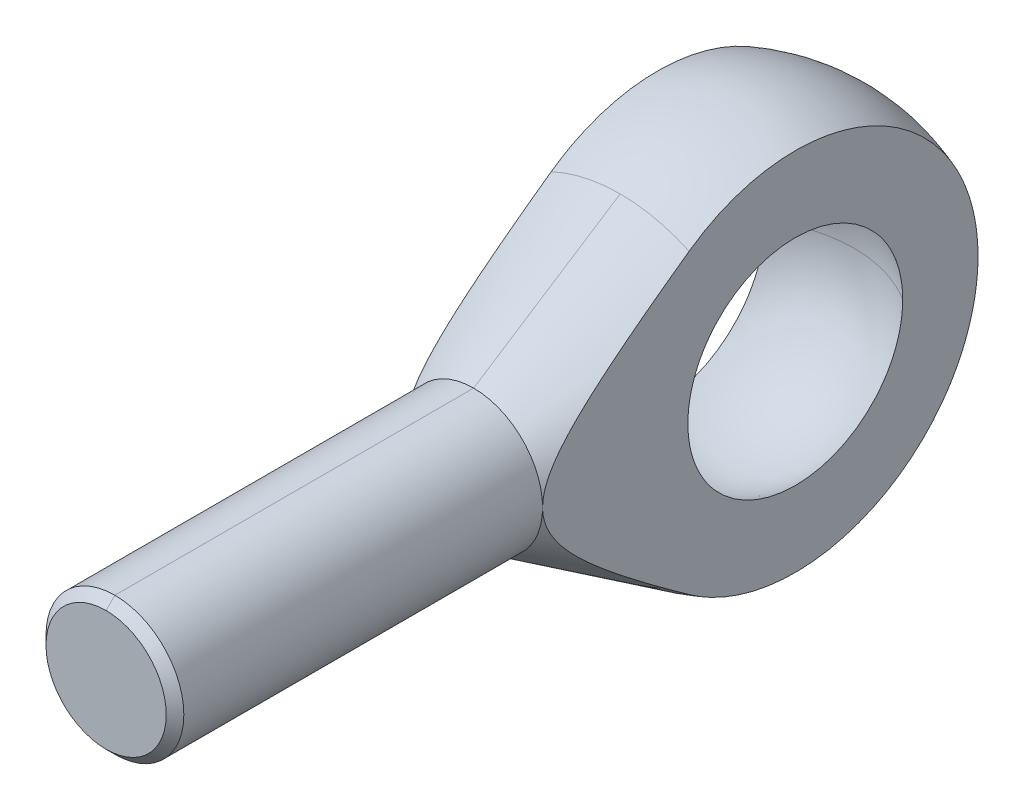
ISO-10303-21;
HEADER;
FILE_DESCRIPTION(('STEP AP214'),'2;1');
FILE_NAME('part.step','',(''),(''),'','','');
FILE_SCHEMA(('AUTOMOTIVE_DESIGN { 1 0 10303 214 1 1 1 1 }'));
ENDSEC;
DATA;
#1=APPLICATION_CONTEXT('core data for automotive mechanical design processes');
#2=APPLICATION_PROTOCOL_DEFINITION('international standard','automotive_design',2000,#1);
#3=PRODUCT_CONTEXT('',#1,'mechanical');
#4=PRODUCT('Part','Part','',(#3));
#5=PRODUCT_RELATED_PRODUCT_CATEGORY('part','',(#4));
#6=PRODUCT_DEFINITION_FORMATION('','',#4);
#7=PRODUCT_DEFINITION_CONTEXT('part definition',#1,'design');
#8=PRODUCT_DEFINITION('design','',#6,#7);
#9=PRODUCT_DEFINITION_SHAPE('','',#8);
#10=(LENGTH_UNIT() NAMED_UNIT(*) SI_UNIT(.MILLI.,.METRE.));
#11=(NAMED_UNIT(*) PLANE_ANGLE_UNIT() SI_UNIT($,.RADIAN.));
#12=(NAMED_UNIT(*) SI_UNIT($,.STERADIAN.) SOLID_ANGLE_UNIT());
#13=UNCERTAINTY_MEASURE_WITH_UNIT(LENGTH_MEASURE(1.E-05),#10,'distance_accuracy_value','');
#14=(GEOMETRIC_REPRESENTATION_CONTEXT(3) GLOBAL_UNCERTAINTY_ASSIGNED_CONTEXT((#13)) GLOBAL_UNIT_ASSIGNED_CONTEXT((#10,
#11,#12)) REPRESENTATION_CONTEXT('',''));
#15=CARTESIAN_POINT('',(0.,0.,0.));
#16=DIRECTION('',(0.,0.,1.));
#17=DIRECTION('',(1.,0.,0.));
#18=AXIS2_PLACEMENT_3D('',#15,#16,#17);
#19=CARTESIAN_POINT('',(0.,0.,53.2329999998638));
#20=DIRECTION('',(0.,0.,-1.));
#21=DIRECTION('',(-1.,0.,0.));
#22=AXIS2_PLACEMENT_3D('',#19,#20,#21);
#23=CONICAL_SURFACE('',#22,6.00000000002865,0.785398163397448);
#24=DIRECTION('',(0.,0.707106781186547,0.707106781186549));
#25=VECTOR('',#24,1.);
#26=CARTESIAN_POINT('',(-6.11078570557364E-11,-499000.,-498940.767000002));
#27=LINE('',#26,#25);
#28=CARTESIAN_POINT('',(0.,-5.23299999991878,53.9999999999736));
#29=VERTEX_POINT('',#28);
#30=CARTESIAN_POINT('',(0.,-6.00000000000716,53.2329999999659));
#31=VERTEX_POINT('',#30);
#32=EDGE_CURVE('E80',#29,#31,#27,.F.);
#33=ORIENTED_EDGE('',*,*,#32,.T.);
#34=CARTESIAN_POINT('',(0.,0.,53.233));
#35=DIRECTION('',(0.,0.,1.));
#36=DIRECTION('',(1.,0.,0.));
#37=AXIS2_PLACEMENT_3D('',#34,#35,#36);
#38=CIRCLE('',#37,6.);
#39=CARTESIAN_POINT('',(0.,6.00000000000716,53.2329999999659));
#40=VERTEX_POINT('',#39);
#41=EDGE_CURVE('E90',#40,#31,#38,.F.);
#42=ORIENTED_EDGE('',*,*,#41,.F.);
#43=DIRECTION('',(0.,-0.707106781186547,0.707106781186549));
#44=VECTOR('',#43,1.);
#45=CARTESIAN_POINT('',(1.22215714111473E-10,499000.,-498940.767000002));
#46=LINE('',#45,#44);
#47=CARTESIAN_POINT('',(0.,5.23299999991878,53.9999999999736));
#48=VERTEX_POINT('',#47);
#49=EDGE_CURVE('E86',#40,#48,#46,.T.);
#50=ORIENTED_EDGE('',*,*,#49,.T.);
#51=CARTESIAN_POINT('',(0.,0.,53.9999999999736));
#52=DIRECTION('',(0.,0.,-1.));
#53=DIRECTION('',(-1.,0.,0.));
#54=AXIS2_PLACEMENT_3D('',#51,#52,#53);
#55=CIRCLE('',#54,5.23299999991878);
#56=EDGE_CURVE('E17',#29,#48,#55,.F.);
#57=ORIENTED_EDGE('',*,*,#56,.F.);
#58=EDGE_LOOP('',(#33,#42,#50,#57));
#59=FACE_BOUND('',#58,.T.);
#60=ADVANCED_FACE('F14',(#59),#23,.T.);
#61=CARTESIAN_POINT('',(0.,2.6165,54.));
#62=DIRECTION('',(0.,0.,1.));
#63=DIRECTION('',(1.,0.,0.));
#64=AXIS2_PLACEMENT_3D('',#61,#62,#63);
#65=PLANE('',#64);
#66=ORIENTED_EDGE('',*,*,#56,.T.);
#67=CARTESIAN_POINT('',(0.,0.,53.9999999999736));
#68=DIRECTION('',(0.,0.,-1.));
#69=DIRECTION('',(-1.,0.,0.));
#70=AXIS2_PLACEMENT_3D('',#67,#68,#69);
#71=CIRCLE('',#70,5.23299999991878);
#72=EDGE_CURVE('E95',#29,#48,#71,.T.);
#73=ORIENTED_EDGE('',*,*,#72,.F.);
#74=EDGE_LOOP('',(#66,#73));
#75=FACE_BOUND('',#74,.T.);
#76=ADVANCED_FACE('F94',(#75),#65,.T.);
#77=CARTESIAN_POINT('',(0.,0.,37.6165));
#78=DIRECTION('',(0.,0.,1.));
#79=DIRECTION('',(1.,0.,0.));
#80=AXIS2_PLACEMENT_3D('',#77,#78,#79);
#81=CYLINDRICAL_SURFACE('',#80,6.);
#82=CARTESIAN_POINT('',(0.,0.,22.));
#83=DIRECTION('',(0.,0.,-1.));
#84=DIRECTION('',(0.,1.,0.));
#85=AXIS2_PLACEMENT_3D('',#82,#83,#84);
#86=CIRCLE('',#85,6.);
#87=CARTESIAN_POINT('',(6.,0.,22.));
#88=VERTEX_POINT('',#87);
#89=CARTESIAN_POINT('',(0.,-6.,22.));
#90=VERTEX_POINT('',#89);
#91=EDGE_CURVE('E189',#88,#90,#86,.T.);
#92=ORIENTED_EDGE('',*,*,#91,.F.);
#93=CARTESIAN_POINT('',(0.,0.,22.));
#94=DIRECTION('',(0.,0.,-1.));
#95=DIRECTION('',(0.,1.,0.));
#96=AXIS2_PLACEMENT_3D('',#93,#94,#95);
#97=CIRCLE('',#96,6.);
#98=CARTESIAN_POINT('',(0.,6.,22.));
#99=VERTEX_POINT('',#98);
#100=EDGE_CURVE('E97',#99,#88,#97,.T.);
#101=ORIENTED_EDGE('',*,*,#100,.F.);
#102=DIRECTION('',(0.,0.,1.));
#103=VECTOR('',#102,1.);
#104=CARTESIAN_POINT('',(0.,6.,37.6165));
#105=LINE('',#104,#103);
#106=EDGE_CURVE('E186',#40,#99,#105,.F.);
#107=ORIENTED_EDGE('',*,*,#106,.F.);
#108=ORIENTED_EDGE('',*,*,#41,.T.);
#109=DIRECTION('',(0.,0.,1.));
#110=VECTOR('',#109,1.);
#111=CARTESIAN_POINT('',(0.,-6.,37.6165));
#112=LINE('',#111,#110);
#113=EDGE_CURVE('E182',#90,#31,#112,.T.);
#114=ORIENTED_EDGE('',*,*,#113,.F.);
#115=EDGE_LOOP('',(#92,#101,#107,#108,#114));
#116=FACE_BOUND('',#115,.T.);
#117=ADVANCED_FACE('F428',(#116),#81,.T.);
#118=CARTESIAN_POINT('',(0.,0.,53.2329999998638));
#119=DIRECTION('',(0.,0.,-1.));
#120=DIRECTION('',(-1.,0.,0.));
#121=AXIS2_PLACEMENT_3D('',#118,#119,#120);
#122=CONICAL_SURFACE('',#121,6.00000000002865,0.785398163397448);
#123=ORIENTED_EDGE('',*,*,#32,.F.);
#124=ORIENTED_EDGE('',*,*,#72,.T.);
#125=ORIENTED_EDGE('',*,*,#49,.F.);
#126=CARTESIAN_POINT('',(0.,0.,53.233));
#127=DIRECTION('',(0.,0.,1.));
#128=DIRECTION('',(1.,0.,0.));
#129=AXIS2_PLACEMENT_3D('',#126,#127,#128);
#130=CIRCLE('',#129,6.);
#131=EDGE_CURVE('E185',#31,#40,#130,.F.);
#132=ORIENTED_EDGE('',*,*,#131,.F.);
#133=EDGE_LOOP('',(#123,#124,#125,#132));
#134=FACE_BOUND('',#133,.T.);
#135=ADVANCED_FACE('F96',(#134),#122,.T.);
#136=CARTESIAN_POINT('',(6.,34.,-32.));
#137=DIRECTION('',(-1.,0.,0.));
#138=DIRECTION('',(0.,0.,1.));
#139=AXIS2_PLACEMENT_3D('',#136,#137,#138);
#140=PLANE('',#139);
#141=CARTESIAN_POINT('',(6.,-12.9428779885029,9.2456427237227));
#142=CARTESIAN_POINT('',(6.,-12.7657292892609,9.49362708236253));
#143=CARTESIAN_POINT('',(6.,-12.5881591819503,9.74131023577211));
#144=CARTESIAN_POINT('',(6.,-12.2320601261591,10.2359882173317));
#145=CARTESIAN_POINT('',(6.,-12.0535311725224,10.4829830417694));
#146=CARTESIAN_POINT('',(6.,-11.5162686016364,11.2228934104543));
#147=CARTESIAN_POINT('',(6.,-11.1559247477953,11.7146430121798));
#148=CARTESIAN_POINT('',(6.,-10.4327631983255,12.689905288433));
#149=CARTESIAN_POINT('',(6.,-10.0699920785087,13.1734524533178));
#150=CARTESIAN_POINT('',(6.,-9.33729585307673,14.1350508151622));
#151=CARTESIAN_POINT('',(6.,-8.96737141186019,14.6131025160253));
#152=CARTESIAN_POINT('',(6.,-8.35871429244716,15.3830880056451));
#153=CARTESIAN_POINT('',(6.,-8.12297703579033,15.6773875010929));
#154=CARTESIAN_POINT('',(6.,-7.64677360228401,16.26213156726));
#155=CARTESIAN_POINT('',(6.,-7.40630757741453,16.5525762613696));
#156=CARTESIAN_POINT('',(6.,-6.91767222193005,17.1305573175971));
#157=CARTESIAN_POINT('',(6.,-6.66945957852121,17.4180571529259));
#158=CARTESIAN_POINT('',(6.,-6.16540681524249,17.9861942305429));
#159=CARTESIAN_POINT('',(6.,-5.90956895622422,18.2668334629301));
#160=CARTESIAN_POINT('',(6.,-5.51669888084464,18.6823442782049));
#161=CARTESIAN_POINT('',(6.,-5.38340133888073,18.8207478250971));
#162=CARTESIAN_POINT('',(6.,-5.11382678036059,19.0946172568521));
#163=CARTESIAN_POINT('',(6.,-4.9775499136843,19.2300832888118));
#164=CARTESIAN_POINT('',(6.,-4.70133538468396,19.4976577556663));
#165=CARTESIAN_POINT('',(6.,-4.56139257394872,19.6297608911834));
#166=CARTESIAN_POINT('',(6.,-4.27747779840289,19.8895684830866));
#167=CARTESIAN_POINT('',(6.,-4.13350602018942,20.0172731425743));
#168=CARTESIAN_POINT('',(6.,-3.84211300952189,20.2661231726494));
#169=CARTESIAN_POINT('',(6.,-3.69473204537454,20.3873154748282));
#170=CARTESIAN_POINT('',(6.,-3.39454811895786,20.6229118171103));
#171=CARTESIAN_POINT('',(6.,-3.24174387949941,20.7373142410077));
#172=CARTESIAN_POINT('',(6.,-2.93034535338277,20.9570716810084));
#173=CARTESIAN_POINT('',(6.,-2.7717680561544,21.0624505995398));
#174=CARTESIAN_POINT('',(6.,-2.44770255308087,21.2618880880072));
#175=CARTESIAN_POINT('',(6.,-2.28221946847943,21.3559548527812));
#176=CARTESIAN_POINT('',(6.,-1.99618164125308,21.5025529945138));
#177=CARTESIAN_POINT('',(6.,-1.87759735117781,21.558921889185));
#178=CARTESIAN_POINT('',(6.,-1.63676132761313,21.6633655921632));
#179=CARTESIAN_POINT('',(6.,-1.514508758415,21.7114384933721));
#180=CARTESIAN_POINT('',(6.,-1.26706324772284,21.7976375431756));
#181=CARTESIAN_POINT('',(6.,-1.14188402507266,21.8358027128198));
#182=CARTESIAN_POINT('',(6.,-0.888697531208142,21.9009778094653));
#183=CARTESIAN_POINT('',(6.,-0.760692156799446,21.927994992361));
#184=CARTESIAN_POINT('',(6.,-0.527477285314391,21.9656661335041));
#185=CARTESIAN_POINT('',(6.,-0.422613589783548,21.9784667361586));
#186=CARTESIAN_POINT('',(6.,-0.211845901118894,21.9956715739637));
#187=CARTESIAN_POINT('',(6.,-0.105939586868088,22.0000472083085));
#188=CARTESIAN_POINT('',(6.,0.,22.));
#189=B_SPLINE_CURVE_WITH_KNOTS('',3,(#141,#142,#143,#144,#145,#146,#147,#148,#149,#150,#151,
#152,#153,#154,#155,#156,#157,#158,#159,#160,#161,#162,#163,#164,#165,#166,#167,#168,#169,#170,
#171,#172,#173,#174,#175,#176,#177,#178,#179,#180,#181,#182,#183,#184,#185,#186,#187,#188),
.UNSPECIFIED.,.F.,.F.,(4,2,2,2,2,2,2,2,2,2,2,2,2,2,2,2,2,2,2,2,2,2,2,4),(0.,0.914275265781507,
1.82855545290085,3.65745417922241,5.4709110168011,7.28420022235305,8.41538335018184,
9.54653018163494,10.6859055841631,11.8249464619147,12.4013775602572,12.9777797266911,
13.5550400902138,14.1322737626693,14.7045476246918,15.2769571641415,15.8478002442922,
16.4182272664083,16.8118682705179,17.2055996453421,17.5977559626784,17.9896566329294,
18.3062556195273,18.6239275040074),.UNSPECIFIED.);
#190=CARTESIAN_POINT('',(6.,-12.9428779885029,9.24564272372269));
#191=VERTEX_POINT('',#190);
#192=EDGE_CURVE('E109',#191,#88,#189,.T.);
#193=ORIENTED_EDGE('',*,*,#192,.F.);
#194=CARTESIAN_POINT('',(6.,0.,-15.9059737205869));
#195=CARTESIAN_POINT('',(6.,-0.298243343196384,-15.9059831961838));
#196=CARTESIAN_POINT('',(6.,-0.596485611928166,-15.8975858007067));
#197=CARTESIAN_POINT('',(6.,-1.19201307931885,-15.8640462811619));
#198=CARTESIAN_POINT('',(6.,-1.48929832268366,-15.8389049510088));
#199=CARTESIAN_POINT('',(6.,-2.08198038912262,-15.7719471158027));
#200=CARTESIAN_POINT('',(6.,-2.37737724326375,-15.7301308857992));
#201=CARTESIAN_POINT('',(6.,-2.96514484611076,-15.6299943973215));
#202=CARTESIAN_POINT('',(6.,-3.25751757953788,-15.5716857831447));
#203=CARTESIAN_POINT('',(6.,-3.8385264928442,-15.438734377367));
#204=CARTESIAN_POINT('',(6.,-4.12716271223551,-15.3640917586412));
#205=CARTESIAN_POINT('',(6.,-4.69976983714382,-15.1987167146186));
#206=CARTESIAN_POINT('',(6.,-4.98374076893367,-15.107984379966));
#207=CARTESIAN_POINT('',(6.,-5.68690693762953,-14.8613244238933));
#208=CARTESIAN_POINT('',(6.,-6.1026673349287,-14.6954915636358));
#209=CARTESIAN_POINT('',(6.,-6.91880378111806,-14.3293476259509));
#210=CARTESIAN_POINT('',(6.,-7.31917779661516,-14.1290320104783));
#211=CARTESIAN_POINT('',(6.,-7.90590574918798,-13.8038651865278));
#212=CARTESIAN_POINT('',(6.,-8.09918623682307,-13.6913539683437));
#213=CARTESIAN_POINT('',(6.,-8.48077920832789,-13.4583190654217));
#214=CARTESIAN_POINT('',(6.,-8.66909307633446,-13.3377976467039));
#215=CARTESIAN_POINT('',(6.,-9.22619471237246,-12.9644560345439));
#216=CARTESIAN_POINT('',(6.,-9.58717622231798,-12.6998397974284));
#217=CARTESIAN_POINT('',(6.,-10.2855270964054,-12.1411678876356));
#218=CARTESIAN_POINT('',(6.,-10.6228958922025,-11.8471115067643));
#219=CARTESIAN_POINT('',(6.,-11.2716776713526,-11.2316156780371));
#220=CARTESIAN_POINT('',(6.,-11.5830906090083,-10.9101761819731));
#221=CARTESIAN_POINT('',(6.,-12.1777728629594,-10.2421609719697));
#222=CARTESIAN_POINT('',(6.,-12.4610380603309,-9.89558159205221));
#223=CARTESIAN_POINT('',(6.,-12.9973633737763,-9.17978987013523));
#224=CARTESIAN_POINT('',(6.,-13.2504235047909,-8.81057753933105));
#225=CARTESIAN_POINT('',(6.,-13.724529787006,-8.05215933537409));
#226=CARTESIAN_POINT('',(6.,-13.9455770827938,-7.6629541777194));
#227=CARTESIAN_POINT('',(6.,-14.3540972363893,-6.86730505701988));
#228=CARTESIAN_POINT('',(6.,-14.5415700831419,-6.46086108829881));
#229=CARTESIAN_POINT('',(6.,-14.8815955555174,-5.63365518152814));
#230=CARTESIAN_POINT('',(6.,-15.0341507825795,-5.21289431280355));
#231=CARTESIAN_POINT('',(6.,-15.303274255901,-4.36001757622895));
#232=CARTESIAN_POINT('',(6.,-15.4198425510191,-3.92790172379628));
#233=CARTESIAN_POINT('',(6.,-15.6161584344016,-3.05541001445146));
#234=CARTESIAN_POINT('',(6.,-15.6959080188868,-2.6150346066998));
#235=CARTESIAN_POINT('',(6.,-15.8180292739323,-1.7291288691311));
#236=CARTESIAN_POINT('',(6.,-15.8604007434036,-1.28359851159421));
#237=CARTESIAN_POINT('',(6.,-15.9074682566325,-0.390468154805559));
#238=CARTESIAN_POINT('',(6.,-15.9121572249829,0.057132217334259));
#239=CARTESIAN_POINT('',(6.,-15.8838081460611,0.951126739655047));
#240=CARTESIAN_POINT('',(6.,-15.8507709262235,1.39752091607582));
#241=CARTESIAN_POINT('',(6.,-15.7471850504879,2.28611561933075));
#242=CARTESIAN_POINT('',(6.,-15.6766214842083,2.72831440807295));
#243=CARTESIAN_POINT('',(6.,-15.4984760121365,3.60519142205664));
#244=CARTESIAN_POINT('',(6.,-15.3908941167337,4.03986964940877));
#245=CARTESIAN_POINT('',(6.,-15.1395743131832,4.89827879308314));
#246=CARTESIAN_POINT('',(6.,-14.9958644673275,5.32201792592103));
#247=CARTESIAN_POINT('',(6.,-14.6733286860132,6.1557422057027));
#248=CARTESIAN_POINT('',(6.,-14.4945152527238,6.56573218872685));
#249=CARTESIAN_POINT('',(6.,-14.1048022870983,7.3654937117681));
#250=CARTESIAN_POINT('',(6.,-13.8942134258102,7.75541668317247));
#251=CARTESIAN_POINT('',(6.,-13.4416929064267,8.51566884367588));
#252=CARTESIAN_POINT('',(6.,-13.1998188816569,8.88603234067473));
#253=CARTESIAN_POINT('',(6.,-12.9428779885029,9.24564272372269));
#254=B_SPLINE_CURVE_WITH_KNOTS('',3,(#194,#195,#196,#197,#198,#199,#200,#201,#202,#203,#204,
#205,#206,#207,#208,#209,#210,#211,#212,#213,#214,#215,#216,#217,#218,#219,#220,#221,#222,#223,
#224,#225,#226,#227,#228,#229,#230,#231,#232,#233,#234,#235,#236,#237,#238,#239,#240,#241,#242,
#243,#244,#245,#246,#247,#248,#249,#250,#251,#252,#253),.UNSPECIFIED.,.F.,.F.,(4,2,2,2,2,2,2,2,
2,2,2,2,2,2,2,2,2,2,2,2,2,2,2,2,2,2,2,2,2,4),(0.,0.894610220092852,1.78917802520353,
2.68373107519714,3.577654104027,4.47156767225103,5.36547620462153,6.70666485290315,
8.04803014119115,8.7187848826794,9.38935067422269,10.7303669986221,12.0714155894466,
13.4124665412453,14.7537134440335,16.0949596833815,17.4361579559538,18.7773566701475,
20.1184554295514,21.45955236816,22.8005765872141,24.1416080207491,25.4828912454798,
26.8241450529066,28.1659321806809,29.5077189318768,30.8484666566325,32.1887377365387,
33.5166652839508,34.8421804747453),.UNSPECIFIED.);
#255=CARTESIAN_POINT('',(6.,0.,-15.9059737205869));
#256=VERTEX_POINT('',#255);
#257=EDGE_CURVE('E265',#256,#191,#254,.T.);
#258=ORIENTED_EDGE('',*,*,#257,.F.);
#259=CARTESIAN_POINT('',(6.,12.9428779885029,9.24564272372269));
#260=CARTESIAN_POINT('',(6.,13.1162451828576,9.0029641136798));
#261=CARTESIAN_POINT('',(6.,13.2827709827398,8.7553997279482));
#262=CARTESIAN_POINT('',(6.,13.6016408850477,8.25131655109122));
#263=CARTESIAN_POINT('',(6.,13.7539856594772,7.99479818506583));
#264=CARTESIAN_POINT('',(6.,14.0440087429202,7.47360532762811));
#265=CARTESIAN_POINT('',(6.,14.1816872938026,7.20893097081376));
#266=CARTESIAN_POINT('',(6.,14.4418558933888,6.67245136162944));
#267=CARTESIAN_POINT('',(6.,14.5643565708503,6.40065126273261));
#268=CARTESIAN_POINT('',(6.,14.7938946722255,5.85059699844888));
#269=CARTESIAN_POINT('',(6.,14.9009322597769,5.57234290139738));
#270=CARTESIAN_POINT('',(6.,15.0992031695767,5.01027842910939));
#271=CARTESIAN_POINT('',(6.,15.1904365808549,4.72646808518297));
#272=CARTESIAN_POINT('',(6.,15.3984548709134,4.01091781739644));
#273=CARTESIAN_POINT('',(6.,15.5051831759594,3.57621525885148));
#274=CARTESIAN_POINT('',(6.,15.6816420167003,2.69928746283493));
#275=CARTESIAN_POINT('',(6.,15.751367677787,2.25706124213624));
#276=CARTESIAN_POINT('',(6.,15.827822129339,1.5906245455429));
#277=CARTESIAN_POINT('',(6.,15.8486183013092,1.36795070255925));
#278=CARTESIAN_POINT('',(6.,15.8808030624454,0.921988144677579));
#279=CARTESIAN_POINT('',(6.,15.8921943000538,0.698699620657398));
#280=CARTESIAN_POINT('',(6.,15.9122275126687,0.0283677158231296));
#281=CARTESIAN_POINT('',(6.,15.9067333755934,-0.419180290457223));
#282=CARTESIAN_POINT('',(6.,15.8580648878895,-1.3121750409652));
#283=CARTESIAN_POINT('',(6.,15.8148896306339,-1.75762173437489));
#284=CARTESIAN_POINT('',(6.,15.6911698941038,-2.64331148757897));
#285=CARTESIAN_POINT('',(6.,15.6106253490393,-3.08355453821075));
#286=CARTESIAN_POINT('',(6.,15.4127236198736,-3.95575073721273));
#287=CARTESIAN_POINT('',(6.,15.2953610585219,-4.38770266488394));
#288=CARTESIAN_POINT('',(6.,15.0246619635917,-5.24018411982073));
#289=CARTESIAN_POINT('',(6.,14.8713254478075,-5.66071365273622));
#290=CARTESIAN_POINT('',(6.,14.5297747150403,-6.48734418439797));
#291=CARTESIAN_POINT('',(6.,14.3415617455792,-6.89344569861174));
#292=CARTESIAN_POINT('',(6.,13.9315926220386,-7.68834918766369));
#293=CARTESIAN_POINT('',(6.,13.7098364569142,-8.07715115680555));
#294=CARTESIAN_POINT('',(6.,13.2343753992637,-8.8346626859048));
#295=CARTESIAN_POINT('',(6.,12.9806728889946,-9.20337374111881));
#296=CARTESIAN_POINT('',(6.,12.4431100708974,-9.91811312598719));
#297=CARTESIAN_POINT('',(6.,12.1592498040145,-10.264141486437));
#298=CARTESIAN_POINT('',(6.,11.5634052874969,-10.931038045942));
#299=CARTESIAN_POINT('',(6.,11.2514225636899,-11.2519076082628));
#300=CARTESIAN_POINT('',(6.,10.6015358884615,-11.8662282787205));
#301=CARTESIAN_POINT('',(6.,10.2636317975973,-12.1596792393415));
#302=CARTESIAN_POINT('',(6.,9.56423998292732,-12.7171272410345));
#303=CARTESIAN_POINT('',(6.,9.2027478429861,-12.9811187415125));
#304=CARTESIAN_POINT('',(6.,8.45881555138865,-13.4777016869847));
#305=CARTESIAN_POINT('',(6.,8.07637585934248,-13.7102938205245));
#306=CARTESIAN_POINT('',(6.,7.29310467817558,-14.1425169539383));
#307=CARTESIAN_POINT('',(6.,6.89226593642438,-14.342134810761));
#308=CARTESIAN_POINT('',(6.,6.07519042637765,-14.7068767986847));
#309=CARTESIAN_POINT('',(6.,5.65895366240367,-14.8720009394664));
#310=CARTESIAN_POINT('',(6.,4.81437173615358,-15.1664653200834));
#311=CARTESIAN_POINT('',(6.,4.38603619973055,-15.2958331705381));
#312=CARTESIAN_POINT('',(6.,3.52014502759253,-15.5179997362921));
#313=CARTESIAN_POINT('',(6.,3.08259272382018,-15.6108114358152));
#314=CARTESIAN_POINT('',(6.,2.20528946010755,-15.758573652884));
#315=CARTESIAN_POINT('',(6.,1.76559586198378,-15.8138649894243));
#316=CARTESIAN_POINT('',(6.,0.883933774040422,-15.8875544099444));
#317=CARTESIAN_POINT('',(6.,0.441970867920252,-15.9060193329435));
#318=CARTESIAN_POINT('',(6.,0.,-15.9059737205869));
#319=B_SPLINE_CURVE_WITH_KNOTS('',3,(#259,#260,#261,#262,#263,#264,#265,#266,#267,#268,#269,
#270,#271,#272,#273,#274,#275,#276,#277,#278,#279,#280,#281,#282,#283,#284,#285,#286,#287,#288,
#289,#290,#291,#292,#293,#294,#295,#296,#297,#298,#299,#300,#301,#302,#303,#304,#305,#306,#307,
#308,#309,#310,#311,#312,#313,#314,#315,#316,#317,#318),.UNSPECIFIED.,.F.,.F.,(4,2,2,2,2,2,2,2,
2,2,2,2,2,2,2,2,2,2,2,2,2,2,2,2,2,2,2,2,2,4),(0.,0.894610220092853,1.78917802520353,
2.68373107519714,3.577654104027,4.47156767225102,5.36547620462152,6.70666485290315,
8.04803014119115,8.7187848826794,9.3893506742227,10.7303669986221,12.0714155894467,
13.4124665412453,14.7537134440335,16.0949596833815,17.4361579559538,18.7773566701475,
20.1184554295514,21.45955236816,22.8005765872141,24.1416080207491,25.4828912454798,
26.8241450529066,28.1659321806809,29.5077189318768,30.8484666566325,32.1887377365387,
33.5166652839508,34.8421804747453),.UNSPECIFIED.);
#320=CARTESIAN_POINT('',(6.,12.9428779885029,9.24564272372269));
#321=VERTEX_POINT('',#320);
#322=EDGE_CURVE('E202',#321,#256,#319,.T.);
#323=ORIENTED_EDGE('',*,*,#322,.F.);
#324=CARTESIAN_POINT('',(6.,0.,22.));
#325=CARTESIAN_POINT('',(6.,0.0646629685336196,22.0000046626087));
#326=CARTESIAN_POINT('',(6.,0.129314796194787,21.998386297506));
#327=CARTESIAN_POINT('',(6.,0.258448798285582,21.9919493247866));
#328=CARTESIAN_POINT('',(6.,0.322930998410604,21.9871312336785));
#329=CARTESIAN_POINT('',(6.,0.515621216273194,21.9679763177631));
#330=CARTESIAN_POINT('',(6.,0.643388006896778,21.9489383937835));
#331=CARTESIAN_POINT('',(6.,0.893948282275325,21.8997337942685));
#332=CARTESIAN_POINT('',(6.,1.01678993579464,21.8698067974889));
#333=CARTESIAN_POINT('',(6.,1.25964877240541,21.799968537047));
#334=CARTESIAN_POINT('',(6.,1.37966422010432,21.7600513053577));
#335=CARTESIAN_POINT('',(6.,1.67346867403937,21.650236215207));
#336=CARTESIAN_POINT('',(6.,1.84532040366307,21.5751578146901));
#337=CARTESIAN_POINT('',(6.,2.18165689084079,21.4100648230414));
#338=CARTESIAN_POINT('',(6.,2.34613728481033,21.3200415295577));
#339=CARTESIAN_POINT('',(6.,2.66994662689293,21.1274058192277));
#340=CARTESIAN_POINT('',(6.,2.82919913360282,21.0246659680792));
#341=CARTESIAN_POINT('',(6.,3.06329799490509,20.8637565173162));
#342=CARTESIAN_POINT('',(6.,3.14052559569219,20.8089935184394));
#343=CARTESIAN_POINT('',(6.,3.29351067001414,20.6974497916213));
#344=CARTESIAN_POINT('',(6.,3.36926815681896,20.640669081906));
#345=CARTESIAN_POINT('',(6.,3.57773546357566,20.4805298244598));
#346=CARTESIAN_POINT('',(6.,3.70897252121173,20.375252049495));
#347=CARTESIAN_POINT('',(6.,3.96766890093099,20.1601402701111));
#348=CARTESIAN_POINT('',(6.,4.0951275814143,20.0503054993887));
#349=CARTESIAN_POINT('',(6.,4.47270437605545,19.7151199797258));
#350=CARTESIAN_POINT('',(6.,4.71788047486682,19.4842004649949));
#351=CARTESIAN_POINT('',(6.,5.19869500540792,19.0115918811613));
#352=CARTESIAN_POINT('',(6.,5.43430796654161,18.7698772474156));
#353=CARTESIAN_POINT('',(6.,5.89756825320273,18.279100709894));
#354=CARTESIAN_POINT('',(6.,6.12521799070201,18.0300410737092));
#355=CARTESIAN_POINT('',(6.,6.57510861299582,17.5254777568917));
#356=CARTESIAN_POINT('',(6.,6.79732675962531,17.2699538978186));
#357=CARTESIAN_POINT('',(6.,7.23675502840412,16.754618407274));
#358=CARTESIAN_POINT('',(6.,7.45396481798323,16.4948064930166));
#359=CARTESIAN_POINT('',(6.,7.88399571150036,15.9722039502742));
#360=CARTESIAN_POINT('',(6.,8.09682262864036,15.7094180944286));
#361=CARTESIAN_POINT('',(6.,8.51911443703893,15.1811738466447));
#362=CARTESIAN_POINT('',(6.,8.72857940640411,14.9157155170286));
#363=CARTESIAN_POINT('',(6.,9.28375231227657,14.2045269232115));
#364=CARTESIAN_POINT('',(6.,9.62697727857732,13.7568592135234));
#365=CARTESIAN_POINT('',(6.,10.307716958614,12.8569360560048));
#366=CARTESIAN_POINT('',(6.,10.6452293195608,12.4046788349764));
#367=CARTESIAN_POINT('',(6.,11.311451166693,11.5025896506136));
#368=CARTESIAN_POINT('',(6.,11.6402180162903,11.0528000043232));
#369=CARTESIAN_POINT('',(6.,12.1306565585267,10.3763138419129));
#370=CARTESIAN_POINT('',(6.,12.2936465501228,10.1505708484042));
#371=CARTESIAN_POINT('',(6.,12.6188344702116,9.69851674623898));
#372=CARTESIAN_POINT('',(6.,12.7810324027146,9.4722056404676));
#373=CARTESIAN_POINT('',(6.,12.9428779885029,9.2456427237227));
#374=B_SPLINE_CURVE_WITH_KNOTS('',3,(#324,#325,#326,#327,#328,#329,#330,#331,#332,#333,#334,
#335,#336,#337,#338,#339,#340,#341,#342,#343,#344,#345,#346,#347,#348,#349,#350,#351,#352,#353,
#354,#355,#356,#357,#358,#359,#360,#361,#362,#363,#364,#365,#366,#367,#368,#369,#370,#371,#372,
#373),.UNSPECIFIED.,.F.,.F.,(4,2,2,2,2,2,2,2,2,2,2,2,2,2,2,2,2,2,2,2,2,2,2,2,4),(0.,
0.193947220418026,0.38786314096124,0.774753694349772,1.15359808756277,1.53266933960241,
2.09429157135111,2.65624198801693,3.22436574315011,3.5083615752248,3.79235484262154,
4.29695354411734,4.8016374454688,5.81154947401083,6.82399510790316,7.83613138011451,
8.85195665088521,9.86784918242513,10.8822939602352,11.8967151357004,13.5889460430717,
15.2818577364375,16.9532371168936,17.7885386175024,18.6238358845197),.UNSPECIFIED.);
#375=EDGE_CURVE('E98',#88,#321,#374,.T.);
#376=ORIENTED_EDGE('',*,*,#375,.F.);
#377=EDGE_LOOP('',(#193,#258,#323,#376));
#378=FACE_BOUND('',#377,.T.);
#379=CARTESIAN_POINT('',(6.,0.,-9.35051335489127));
#380=CARTESIAN_POINT('',(6.,-0.262986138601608,-9.35054163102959));
#381=CARTESIAN_POINT('',(6.,-0.525968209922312,-9.33941968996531));
#382=CARTESIAN_POINT('',(6.,-1.05005089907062,-9.29507960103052));
#383=CARTESIAN_POINT('',(6.,-1.31115160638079,-9.2618625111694));
#384=CARTESIAN_POINT('',(6.,-1.82944156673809,-9.17356735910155));
#385=CARTESIAN_POINT('',(6.,-2.08663344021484,-9.11850467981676));
#386=CARTESIAN_POINT('',(6.,-2.5954638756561,-8.98691894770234));
#387=CARTESIAN_POINT('',(6.,-2.84710250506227,-8.91039615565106));
#388=CARTESIAN_POINT('',(6.,-3.34315610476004,-8.73639104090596));
#389=CARTESIAN_POINT('',(6.,-3.58756769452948,-8.63889908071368));
#390=CARTESIAN_POINT('',(6.,-4.06731334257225,-8.42366802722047));
#391=CARTESIAN_POINT('',(6.,-4.30264720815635,-8.30592850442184));
#392=CARTESIAN_POINT('',(6.,-4.76251129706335,-8.05106698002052));
#393=CARTESIAN_POINT('',(6.,-4.98704372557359,-7.91394895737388));
#394=CARTESIAN_POINT('',(6.,-5.42375957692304,-7.62128759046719));
#395=CARTESIAN_POINT('',(6.,-5.63594305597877,-7.4657443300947));
#396=CARTESIAN_POINT('',(6.,-6.04645949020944,-7.13733311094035));
#397=CARTESIAN_POINT('',(6.,-6.24479206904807,-6.96446468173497));
#398=CARTESIAN_POINT('',(6.,-6.62618947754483,-6.60263648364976));
#399=CARTESIAN_POINT('',(6.,-6.80925439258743,-6.41367680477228));
#400=CARTESIAN_POINT('',(6.,-7.15884365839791,-6.02097786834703));
#401=CARTESIAN_POINT('',(6.,-7.32536543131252,-5.81723631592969));
#402=CARTESIAN_POINT('',(6.,-7.64065191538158,-5.39644839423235));
#403=CARTESIAN_POINT('',(6.,-7.78941663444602,-5.17940203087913));
#404=CARTESIAN_POINT('',(6.,-8.06810100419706,-4.7335962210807));
#405=CARTESIAN_POINT('',(6.,-8.19802474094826,-4.50483932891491));
#406=CARTESIAN_POINT('',(6.,-8.43818385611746,-4.03711381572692));
#407=CARTESIAN_POINT('',(6.,-8.54841239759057,-3.79814168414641));
#408=CARTESIAN_POINT('',(6.,-8.74831700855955,-3.31181976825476));
#409=CARTESIAN_POINT('',(6.,-8.83799816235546,-3.06447207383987));
#410=CARTESIAN_POINT('',(6.,-8.99620711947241,-2.56309595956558));
#411=CARTESIAN_POINT('',(6.,-9.06473448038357,-2.3090674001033));
#412=CARTESIAN_POINT('',(6.,-9.18014610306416,-1.79614057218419));
#413=CARTESIAN_POINT('',(6.,-9.22703037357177,-1.53724230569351));
#414=CARTESIAN_POINT('',(6.,-9.29882330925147,-1.01641102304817));
#415=CARTESIAN_POINT('',(6.,-9.32373151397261,-0.754477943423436));
#416=CARTESIAN_POINT('',(6.,-9.35139373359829,-0.22944125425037));
#417=CARTESIAN_POINT('',(6.,-9.35414747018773,0.0336623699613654));
#418=CARTESIAN_POINT('',(6.,-9.33748044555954,0.559166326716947));
#419=CARTESIAN_POINT('',(6.,-9.31805968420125,0.821566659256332));
#420=CARTESIAN_POINT('',(6.,-9.25718171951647,1.34379862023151));
#421=CARTESIAN_POINT('',(6.,-9.21572450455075,1.60363024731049));
#422=CARTESIAN_POINT('',(6.,-9.11106946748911,2.11887196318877));
#423=CARTESIAN_POINT('',(6.,-9.04787210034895,2.37428214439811));
#424=CARTESIAN_POINT('',(6.,-8.9001845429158,2.87887526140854));
#425=CARTESIAN_POINT('',(6.,-8.81569397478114,3.12805808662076));
#426=CARTESIAN_POINT('',(6.,-8.62602326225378,3.61841505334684));
#427=CARTESIAN_POINT('',(6.,-8.52084355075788,3.85958936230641));
#428=CARTESIAN_POINT('',(6.,-8.29051694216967,4.33226991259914));
#429=CARTESIAN_POINT('',(6.,-8.16536585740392,4.56377411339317));
#430=CARTESIAN_POINT('',(6.,-7.89604916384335,5.01533584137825));
#431=CARTESIAN_POINT('',(6.,-7.75189015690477,5.23539730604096));
#432=CARTESIAN_POINT('',(6.,-7.44552953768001,5.66262245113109));
#433=CARTESIAN_POINT('',(6.,-7.28332567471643,5.86978451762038));
#434=CARTESIAN_POINT('',(6.,-6.94204343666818,6.26970779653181));
#435=CARTESIAN_POINT('',(6.,-6.76296509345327,6.46246903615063));
#436=CARTESIAN_POINT('',(6.,-6.38923224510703,6.83219550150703));
#437=CARTESIAN_POINT('',(6.,-6.19457986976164,7.00916288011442));
#438=CARTESIAN_POINT('',(6.,-5.79105992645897,7.34607444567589));
#439=CARTESIAN_POINT('',(6.,-5.58219227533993,7.50601853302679));
#440=CARTESIAN_POINT('',(6.,-5.15165600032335,7.80779553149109));
#441=CARTESIAN_POINT('',(6.,-4.92998316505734,7.94962243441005));
#442=CARTESIAN_POINT('',(6.,-4.47548270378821,8.21409037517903));
#443=CARTESIAN_POINT('',(6.,-4.24265541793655,8.33673199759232));
#444=CARTESIAN_POINT('',(6.,-3.7673444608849,8.56203428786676));
#445=CARTESIAN_POINT('',(6.,-3.52485472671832,8.6646821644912));
#446=CARTESIAN_POINT('',(6.,-3.03208936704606,8.84916618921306));
#447=CARTESIAN_POINT('',(6.,-2.78181395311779,8.93100290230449));
#448=CARTESIAN_POINT('',(6.,-2.27558516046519,9.07319422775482));
#449=CARTESIAN_POINT('',(6.,-2.01963943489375,9.13357611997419));
#450=CARTESIAN_POINT('',(6.,-1.50367417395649,9.23255197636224));
#451=CARTESIAN_POINT('',(6.,-1.2436567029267,9.27115663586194));
#452=CARTESIAN_POINT('',(6.,-0.819227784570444,9.31600474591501));
#453=CARTESIAN_POINT('',(6.,-0.6554957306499,9.32895372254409));
#454=CARTESIAN_POINT('',(6.,-0.327848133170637,9.34620182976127));
#455=CARTESIAN_POINT('',(6.,-0.16393334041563,9.35051522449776));
#456=CARTESIAN_POINT('',(6.,-1.71217207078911E-12,9.35051335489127));
#457=B_SPLINE_CURVE_WITH_KNOTS('',3,(#379,#380,#381,#382,#383,#384,#385,#386,#387,#388,#389,
#390,#391,#392,#393,#394,#395,#396,#397,#398,#399,#400,#401,#402,#403,#404,#405,#406,#407,#408,
#409,#410,#411,#412,#413,#414,#415,#416,#417,#418,#419,#420,#421,#422,#423,#424,#425,#426,#427,
#428,#429,#430,#431,#432,#433,#434,#435,#436,#437,#438,#439,#440,#441,#442,#443,#444,#445,#446,
#447,#448,#449,#450,#451,#452,#453,#454,#455,#456),.UNSPECIFIED.,.F.,.F.,(4,2,2,2,2,2,2,2,2,2,2,
2,2,2,2,2,2,2,2,2,2,2,2,2,2,2,2,2,2,2,2,2,2,2,2,2,2,2,4),(0.,0.788717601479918,1.57739743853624,
2.3655228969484,3.1536387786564,3.94211765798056,4.73061326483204,5.51894720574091,
6.30727755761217,7.09562932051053,7.88397667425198,8.67244668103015,9.46091633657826,
10.249214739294,11.0377862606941,11.8261624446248,12.6145551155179,13.4029474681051,
14.1913563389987,14.9797751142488,15.7681938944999,16.5566130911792,17.3450157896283,
18.1334324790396,18.9218326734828,19.7103984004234,20.4986909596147,21.2870819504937,
22.0754714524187,22.8637533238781,23.6520398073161,24.4405870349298,25.22911023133,
26.0181362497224,26.8071408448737,27.595138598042,28.3827490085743,28.8752696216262,
29.3669760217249),.UNSPECIFIED.);
#458=CARTESIAN_POINT('',(6.,0.,-9.35051335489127));
#459=VERTEX_POINT('',#458);
#460=CARTESIAN_POINT('',(6.,-5.9885320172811E-12,9.35051335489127));
#461=VERTEX_POINT('',#460);
#462=EDGE_CURVE('E287',#459,#461,#457,.T.);
#463=ORIENTED_EDGE('',*,*,#462,.T.);
#464=CARTESIAN_POINT('',(6.,-1.71217207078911E-12,9.35051335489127));
#465=CARTESIAN_POINT('',(6.,0.262993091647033,9.35054163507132));
#466=CARTESIAN_POINT('',(6.,0.525982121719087,9.33941910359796));
#467=CARTESIAN_POINT('',(6.,1.05007855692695,9.29507667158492));
#468=CARTESIAN_POINT('',(6.,1.31118605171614,9.26185783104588));
#469=CARTESIAN_POINT('',(6.,1.82947561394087,9.17356037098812));
#470=CARTESIAN_POINT('',(6.,2.08666049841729,9.11849828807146));
#471=CARTESIAN_POINT('',(6.,2.59547718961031,8.9869148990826));
#472=CARTESIAN_POINT('',(6.,2.84710906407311,8.91039385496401));
#473=CARTESIAN_POINT('',(6.,3.34315359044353,8.73639192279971));
#474=CARTESIAN_POINT('',(6.,3.5875627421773,8.6389010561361));
#475=CARTESIAN_POINT('',(6.,4.06730369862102,8.42367260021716));
#476=CARTESIAN_POINT('',(6.,4.30263531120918,8.30593458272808));
#477=CARTESIAN_POINT('',(6.,4.76249992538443,8.05107379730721));
#478=CARTESIAN_POINT('',(6.,4.98703490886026,7.91395460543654));
#479=CARTESIAN_POINT('',(6.,5.42375544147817,7.62129062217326));
#480=CARTESIAN_POINT('',(6.,5.63594105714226,7.46574593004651));
#481=CARTESIAN_POINT('',(6.,6.04645445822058,7.13733713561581));
#482=CARTESIAN_POINT('',(6.,6.24478234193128,6.96447315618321));
#483=CARTESIAN_POINT('',(6.,6.62617221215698,6.60265361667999));
#484=CARTESIAN_POINT('',(6.,6.8092341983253,6.41369805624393));
#485=CARTESIAN_POINT('',(6.,7.15882670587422,6.02099834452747));
#486=CARTESIAN_POINT('',(6.,7.32535385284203,5.81725118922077));
#487=CARTESIAN_POINT('',(6.,7.64064767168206,5.39645463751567));
#488=CARTESIAN_POINT('',(6.,7.78941461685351,5.17940544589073));
#489=CARTESIAN_POINT('',(6.,8.06816283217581,4.7334971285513));
#490=CARTESIAN_POINT('',(6.,8.19814011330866,4.50463550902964));
#491=CARTESIAN_POINT('',(6.,8.43834455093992,4.03677994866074));
#492=CARTESIAN_POINT('',(6.,8.54857203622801,3.79778617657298));
#493=CARTESIAN_POINT('',(6.,8.74845052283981,3.3114620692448));
#494=CARTESIAN_POINT('',(6.,8.83811094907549,3.06413561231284));
#495=CARTESIAN_POINT('',(6.,8.99626012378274,2.5629069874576));
#496=CARTESIAN_POINT('',(6.,9.06475396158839,2.30900641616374));
#497=CARTESIAN_POINT('',(6.,9.19819584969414,1.71588800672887));
#498=CARTESIAN_POINT('',(6.,9.25531302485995,1.37485733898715));
#499=CARTESIAN_POINT('',(6.,9.31242649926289,0.860573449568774));
#500=CARTESIAN_POINT('',(6.,9.32670393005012,0.688776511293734));
#501=CARTESIAN_POINT('',(6.,9.34574621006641,0.344667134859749));
#502=CARTESIAN_POINT('',(6.,9.35051166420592,0.1723547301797));
#503=CARTESIAN_POINT('',(6.,9.35051335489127,0.));
#504=B_SPLINE_CURVE_WITH_KNOTS('',3,(#464,#465,#466,#467,#468,#469,#470,#471,#472,#473,#474,
#475,#476,#477,#478,#479,#480,#481,#482,#483,#484,#485,#486,#487,#488,#489,#490,#491,#492,#493,
#494,#495,#496,#497,#498,#499,#500,#501,#502,#503),.UNSPECIFIED.,.F.,.F.,(4,2,2,2,2,2,2,2,2,2,2,
2,2,2,2,2,2,2,2,4),(0.,0.788738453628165,1.57743907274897,2.3655437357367,3.15363877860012,
3.94210967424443,4.73059724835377,5.51893952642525,6.30727755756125,7.09560999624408,
7.88394245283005,8.6724354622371,9.46091633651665,10.2495643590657,11.0381992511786,
11.8264720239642,12.6145551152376,13.6494909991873,14.166437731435,14.683351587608),.UNSPECIFIED.);
#505=CARTESIAN_POINT('',(6.,9.35051335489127,0.));
#506=VERTEX_POINT('',#505);
#507=EDGE_CURVE('E301',#461,#506,#504,.T.);
#508=ORIENTED_EDGE('',*,*,#507,.T.);
#509=CARTESIAN_POINT('',(6.,9.35051335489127,0.));
#510=CARTESIAN_POINT('',(6.,9.35054163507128,-0.262993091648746));
#511=CARTESIAN_POINT('',(6.,9.33941910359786,-0.525982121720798));
#512=CARTESIAN_POINT('',(6.,9.29507667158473,-1.05007855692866));
#513=CARTESIAN_POINT('',(6.,9.26185783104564,-1.31118605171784));
#514=CARTESIAN_POINT('',(6.,9.17356037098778,-1.82947561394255));
#515=CARTESIAN_POINT('',(6.,9.11849828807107,-2.08666049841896));
#516=CARTESIAN_POINT('',(6.,8.98691489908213,-2.59547718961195));
#517=CARTESIAN_POINT('',(6.,8.9103938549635,-2.84710906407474));
#518=CARTESIAN_POINT('',(6.,8.7363919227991,-3.34315359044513));
#519=CARTESIAN_POINT('',(6.,8.63890105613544,-3.58756274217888));
#520=CARTESIAN_POINT('',(6.,8.42367260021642,-4.06730369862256));
#521=CARTESIAN_POINT('',(6.,8.30593458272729,-4.30263531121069));
#522=CARTESIAN_POINT('',(6.,8.05107379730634,-4.7624999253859));
#523=CARTESIAN_POINT('',(6.,7.91395460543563,-4.9870349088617));
#524=CARTESIAN_POINT('',(6.,7.62129062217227,-5.42375544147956));
#525=CARTESIAN_POINT('',(6.,7.46574593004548,-5.63594105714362));
#526=CARTESIAN_POINT('',(6.,7.1373371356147,-6.04645445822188));
#527=CARTESIAN_POINT('',(6.,6.96447315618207,-6.24478234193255));
#528=CARTESIAN_POINT('',(6.,6.60265361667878,-6.62617221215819));
#529=CARTESIAN_POINT('',(6.,6.41369805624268,-6.80923419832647));
#530=CARTESIAN_POINT('',(6.,6.02099834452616,-7.15882670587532));
#531=CARTESIAN_POINT('',(6.,5.81725118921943,-7.32535385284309));
#532=CARTESIAN_POINT('',(6.,5.39645463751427,-7.64064767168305));
#533=CARTESIAN_POINT('',(6.,5.17940544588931,-7.78941461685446));
#534=CARTESIAN_POINT('',(6.,4.73349712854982,-8.06816283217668));
#535=CARTESIAN_POINT('',(6.,4.50463550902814,-8.19814011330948));
#536=CARTESIAN_POINT('',(6.,4.03677994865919,-8.43834455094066));
#537=CARTESIAN_POINT('',(6.,3.79778617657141,-8.54857203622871));
#538=CARTESIAN_POINT('',(6.,3.31146206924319,-8.74845052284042));
#539=CARTESIAN_POINT('',(6.,3.06413561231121,-8.83811094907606));
#540=CARTESIAN_POINT('',(6.,2.56290698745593,-8.99626012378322));
#541=CARTESIAN_POINT('',(6.,2.30900641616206,-9.06475396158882));
#542=CARTESIAN_POINT('',(6.,1.71588800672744,-9.19819584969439));
#543=CARTESIAN_POINT('',(6.,1.37485733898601,-9.25531302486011));
#544=CARTESIAN_POINT('',(6.,0.860573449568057,-9.31242649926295));
#545=CARTESIAN_POINT('',(6.,0.688776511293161,-9.32670393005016));
#546=CARTESIAN_POINT('',(6.,0.344667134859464,-9.34574621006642));
#547=CARTESIAN_POINT('',(6.,0.172354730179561,-9.35051166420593));
#548=CARTESIAN_POINT('',(6.,0.,-9.35051335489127));
#549=B_SPLINE_CURVE_WITH_KNOTS('',3,(#509,#510,#511,#512,#513,#514,#515,#516,#517,#518,#519,
#520,#521,#522,#523,#524,#525,#526,#527,#528,#529,#530,#531,#532,#533,#534,#535,#536,#537,#538,
#539,#540,#541,#542,#543,#544,#545,#546,#547,#548),.UNSPECIFIED.,.F.,.F.,(4,2,2,2,2,2,2,2,2,2,2,
2,2,2,2,2,2,2,2,4),(0.,0.788738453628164,1.57743907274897,2.36554373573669,3.15363877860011,
3.94210967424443,4.73059724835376,5.51893952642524,6.30727755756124,7.09560999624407,
7.88394245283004,8.67243546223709,9.46091633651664,10.2495643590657,11.0381992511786,
11.8264720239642,12.6145551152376,13.6494909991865,14.1664377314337,14.6833515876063),.UNSPECIFIED.);
#550=EDGE_CURVE('E292',#506,#459,#549,.T.);
#551=ORIENTED_EDGE('',*,*,#550,.T.);
#552=EDGE_LOOP('',(#463,#508,#551));
#553=FACE_BOUND('',#552,.T.);
#554=ADVANCED_FACE('F116',(#378,#553),#140,.F.);
#555=CARTESIAN_POINT('',(0.,0.,9.24564272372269));
#556=DIRECTION('',(0.,0.,-1.));
#557=DIRECTION('',(-1.,0.,0.));
#558=AXIS2_PLACEMENT_3D('',#555,#556,#557);
#559=CONICAL_SURFACE('',#558,14.2659766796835,0.575031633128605);
#560=ORIENTED_EDGE('',*,*,#375,.T.);
#561=CARTESIAN_POINT('',(0.,0.,9.24564272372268));
#562=DIRECTION('',(0.,0.,1.));
#563=DIRECTION('',(0.,1.,0.));
#564=AXIS2_PLACEMENT_3D('',#561,#562,#563);
#565=CIRCLE('',#564,14.2659766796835);
#566=CARTESIAN_POINT('',(0.,14.2659766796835,9.24564272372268));
#567=VERTEX_POINT('',#566);
#568=EDGE_CURVE('E244',#567,#321,#565,.F.);
#569=ORIENTED_EDGE('',*,*,#568,.F.);
#570=DIRECTION('',(0.,-0.54386133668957,0.839175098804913));
#571=VECTOR('',#570,1.);
#572=CARTESIAN_POINT('',(0.,10.1329883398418,15.6228213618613));
#573=LINE('',#572,#571);
#574=EDGE_CURVE('E198',#99,#567,#573,.F.);
#575=ORIENTED_EDGE('',*,*,#574,.F.);
#576=ORIENTED_EDGE('',*,*,#100,.T.);
#577=EDGE_LOOP('',(#560,#569,#575,#576));
#578=FACE_BOUND('',#577,.T.);
#579=ADVANCED_FACE('F119',(#578),#559,.T.);
#580=CARTESIAN_POINT('',(0.,0.,9.24564272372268));
#581=DIRECTION('',(0.,0.,-1.));
#582=DIRECTION('',(-1.,0.,0.));
#583=AXIS2_PLACEMENT_3D('',#580,#581,#582);
#584=CONICAL_SURFACE('',#583,14.2659766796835,0.575031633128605);
#585=ORIENTED_EDGE('',*,*,#192,.T.);
#586=ORIENTED_EDGE('',*,*,#91,.T.);
#587=DIRECTION('',(0.,0.54386133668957,0.839175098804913));
#588=VECTOR('',#587,1.);
#589=CARTESIAN_POINT('',(0.,-10.1329883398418,15.6228213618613));
#590=LINE('',#589,#588);
#591=CARTESIAN_POINT('',(0.,-14.2659766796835,9.24564272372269));
#592=VERTEX_POINT('',#591);
#593=EDGE_CURVE('E172',#592,#90,#590,.T.);
#594=ORIENTED_EDGE('',*,*,#593,.F.);
#595=CARTESIAN_POINT('',(0.,0.,9.24564272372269));
#596=DIRECTION('',(0.,0.,1.));
#597=DIRECTION('',(0.,1.,0.));
#598=AXIS2_PLACEMENT_3D('',#595,#596,#597);
#599=CIRCLE('',#598,14.2659766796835);
#600=EDGE_CURVE('E262',#191,#592,#599,.F.);
#601=ORIENTED_EDGE('',*,*,#600,.F.);
#602=EDGE_LOOP('',(#585,#586,#594,#601));
#603=FACE_BOUND('',#602,.T.);
#604=ADVANCED_FACE('F122',(#603),#584,.T.);
#605=CARTESIAN_POINT('',(0.,0.,37.6165));
#606=DIRECTION('',(0.,0.,1.));
#607=DIRECTION('',(1.,0.,0.));
#608=AXIS2_PLACEMENT_3D('',#605,#606,#607);
#609=CYLINDRICAL_SURFACE('',#608,6.);
#610=ORIENTED_EDGE('',*,*,#113,.T.);
#611=ORIENTED_EDGE('',*,*,#131,.T.);
#612=ORIENTED_EDGE('',*,*,#106,.T.);
#613=CARTESIAN_POINT('',(0.,0.,22.));
#614=DIRECTION('',(0.,0.,-1.));
#615=DIRECTION('',(0.,1.,0.));
#616=AXIS2_PLACEMENT_3D('',#613,#614,#615);
#617=CIRCLE('',#616,6.);
#618=CARTESIAN_POINT('',(-6.,0.,22.));
#619=VERTEX_POINT('',#618);
#620=EDGE_CURVE('E179',#619,#99,#617,.T.);
#621=ORIENTED_EDGE('',*,*,#620,.F.);
#622=CARTESIAN_POINT('',(0.,0.,22.));
#623=DIRECTION('',(0.,0.,-1.));
#624=DIRECTION('',(0.,1.,0.));
#625=AXIS2_PLACEMENT_3D('',#622,#623,#624);
#626=CIRCLE('',#625,6.);
#627=EDGE_CURVE('E31',#90,#619,#626,.T.);
#628=ORIENTED_EDGE('',*,*,#627,.F.);
#629=EDGE_LOOP('',(#610,#611,#612,#621,#628));
#630=FACE_BOUND('',#629,.T.);
#631=ADVANCED_FACE('F127',(#630),#609,.T.);
#632=CARTESIAN_POINT('',(0.,0.,0.));
#633=DIRECTION('',(0.,0.,1.));
#634=DIRECTION('',(0.,1.,0.));
#635=AXIS2_PLACEMENT_3D('',#632,#633,#634);
#636=SPHERICAL_SURFACE('',#635,11.11);
#637=CARTESIAN_POINT('',(0.,0.,-11.11));
#638=CARTESIAN_POINT('',(0.132047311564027,9.82063363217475E-13,-11.1100010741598));
#639=CARTESIAN_POINT('',(0.264094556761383,1.84167961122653E-12,-11.1076458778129));
#640=CARTESIAN_POINT('',(0.528021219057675,3.33763737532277E-12,-11.0982306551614));
#641=CARTESIAN_POINT('',(0.659900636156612,3.97397889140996E-12,-11.0911706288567));
#642=CARTESIAN_POINT('',(0.923323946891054,5.04500669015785E-12,-11.0723534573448));
#643=CARTESIAN_POINT('',(1.05486784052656,5.47969297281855E-12,-11.0605963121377));
#644=CARTESIAN_POINT('',(1.31745289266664,6.17182500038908E-12,-11.0324001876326));
#645=CARTESIAN_POINT('',(1.44849405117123,6.42927074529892E-12,-11.0159612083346));
#646=CARTESIAN_POINT('',(1.70990704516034,6.78836311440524E-12,-10.9784222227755));
#647=CARTESIAN_POINT('',(1.84027888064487,6.89000973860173E-12,-10.9573222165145));
#648=CARTESIAN_POINT('',(2.10018749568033,6.96512188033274E-12,-10.9104880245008));
#649=CARTESIAN_POINT('',(2.22972427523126,6.93858739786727E-12,-10.8847538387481));
#650=CARTESIAN_POINT('',(2.48779810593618,6.77442115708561E-12,-10.8286839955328));
#651=CARTESIAN_POINT('',(2.61633515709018,6.63678939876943E-12,-10.7983483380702));
#652=CARTESIAN_POINT('',(2.87224612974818,6.28052691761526E-12,-10.7331141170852));
#653=CARTESIAN_POINT('',(2.99962005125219,6.06189619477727E-12,-10.6982155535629));
#654=CARTESIAN_POINT('',(3.25304284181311,5.56594284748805E-12,-10.6238998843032));
#655=CARTESIAN_POINT('',(3.37909171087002,5.28862022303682E-12,-10.5844827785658));
#656=CARTESIAN_POINT('',(3.62970415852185,4.69509050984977E-12,-10.5011801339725));
#657=CARTESIAN_POINT('',(3.75426773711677,4.37888342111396E-12,-10.4572945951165));
#658=CARTESIAN_POINT('',(4.00175125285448,3.73461421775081E-12,-10.3651108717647));
#659=CARTESIAN_POINT('',(4.12467118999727,3.40655210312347E-12,-10.3168126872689));
#660=CARTESIAN_POINT('',(4.36871116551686,2.7625843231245E-12,-10.2158650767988));
#661=CARTESIAN_POINT('',(4.48983120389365,2.44667865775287E-12,-10.1632156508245));
#662=CARTESIAN_POINT('',(4.7301173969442,1.84264237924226E-12,-10.0536324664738));
#663=CARTESIAN_POINT('',(4.84928355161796,1.55451176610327E-12,-9.99669870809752));
#664=CARTESIAN_POINT('',(5.08551053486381,1.03788093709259E-12,-9.87861931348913));
#665=CARTESIAN_POINT('',(5.2025713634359,8.0938072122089E-13,-9.81747367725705));
#666=CARTESIAN_POINT('',(5.43443870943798,4.26296018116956E-13,-9.69104796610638));
#667=CARTESIAN_POINT('',(5.54924522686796,2.7171153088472E-13,-9.62576789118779));
#668=CARTESIAN_POINT('',(5.77645864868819,0.,-9.49115737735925));
#669=CARTESIAN_POINT('',(5.88886555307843,0.,-9.42182693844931));
#670=CARTESIAN_POINT('',(5.99999999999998,0.,-9.35051335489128));
#671=B_SPLINE_CURVE_WITH_KNOTS('',3,(#637,#638,#639,#640,#641,#642,#643,#644,#645,#646,#647,
#648,#649,#650,#651,#652,#653,#654,#655,#656,#657,#658,#659,#660,#661,#662,#663,#664,#665,#666,
#667,#668,#669,#670),.UNSPECIFIED.,.F.,.F.,(4,2,2,2,2,2,2,2,2,2,2,2,2,2,2,2,4),(0.,
0.396120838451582,0.792241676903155,1.18836251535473,1.5844833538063,1.98060419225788,
2.37672503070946,2.77284586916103,3.1689667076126,3.56508754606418,3.96120838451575,
4.35732922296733,4.7534500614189,5.14957089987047,5.54569173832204,5.94181257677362,
6.33793341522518),.UNSPECIFIED.);
#672=CARTESIAN_POINT('',(0.,0.,-11.11));
#673=VERTEX_POINT('',#672);
#674=EDGE_CURVE('E168',#673,#459,#671,.T.);
#675=ORIENTED_EDGE('',*,*,#674,.T.);
#676=ORIENTED_EDGE('',*,*,#550,.F.);
#677=ORIENTED_EDGE('',*,*,#507,.F.);
#678=CARTESIAN_POINT('',(0.,0.,0.));
#679=DIRECTION('',(1.71081532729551E-12,1.,0.));
#680=DIRECTION('',(0.,0.,1.));
#681=AXIS2_PLACEMENT_3D('',#678,#679,#680);
#682=CIRCLE('',#681,11.11);
#683=CARTESIAN_POINT('',(0.,0.,11.11));
#684=VERTEX_POINT('',#683);
#685=EDGE_CURVE('E285',#461,#684,#682,.F.);
#686=ORIENTED_EDGE('',*,*,#685,.T.);
#687=CARTESIAN_POINT('',(0.,0.,11.11));
#688=CARTESIAN_POINT('',(-0.132047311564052,-9.82803714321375E-13,11.1100010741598));
#689=CARTESIAN_POINT('',(-0.264094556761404,-1.84271902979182E-12,11.1076458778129));
#690=CARTESIAN_POINT('',(-0.528021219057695,-3.3389814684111E-12,11.0982306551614));
#691=CARTESIAN_POINT('',(-0.659900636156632,-3.97532859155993E-12,11.0911706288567));
#692=CARTESIAN_POINT('',(-0.923323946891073,-5.04666325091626E-12,11.0723534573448));
#693=CARTESIAN_POINT('',(-1.05486784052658,-5.48165078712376E-12,11.0605963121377));
#694=CARTESIAN_POINT('',(-1.31745289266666,-6.17384503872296E-12,11.0324001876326));
#695=CARTESIAN_POINT('',(-1.44849405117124,-6.43105175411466E-12,11.0159612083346));
#696=CARTESIAN_POINT('',(-1.70990704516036,-6.79047542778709E-12,10.9784222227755));
#697=CARTESIAN_POINT('',(-1.84027888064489,-6.89269238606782E-12,10.9573222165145));
#698=CARTESIAN_POINT('',(-2.10018749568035,-6.96642163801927E-12,10.9104880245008));
#699=CARTESIAN_POINT('',(-2.22972427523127,-6.93793393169E-12,10.8847538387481));
#700=CARTESIAN_POINT('',(-2.4877981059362,-6.77355735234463E-12,10.8286839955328));
#701=CARTESIAN_POINT('',(-2.61633515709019,-6.63766847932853E-12,10.7983483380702));
#702=CARTESIAN_POINT('',(-2.87224612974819,-6.28275741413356E-12,10.7331141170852));
#703=CARTESIAN_POINT('',(-2.9996200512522,-6.06373522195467E-12,10.6982155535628));
#704=CARTESIAN_POINT('',(-3.25304284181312,-5.56486955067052E-12,10.6238998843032));
#705=CARTESIAN_POINT('',(-3.37909171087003,-5.28502607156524E-12,10.5844827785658));
#706=CARTESIAN_POINT('',(-3.62970415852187,-4.69020539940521E-12,10.5011801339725));
#707=CARTESIAN_POINT('',(-3.75426773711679,-4.37522820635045E-12,10.4572945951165));
#708=CARTESIAN_POINT('',(-4.0017512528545,-3.7323305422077E-12,10.3651108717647));
#709=CARTESIAN_POINT('',(-4.12467118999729,-3.40441007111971E-12,10.3168126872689));
#710=CARTESIAN_POINT('',(-4.36871116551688,-2.75822285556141E-12,10.2158650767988));
#711=CARTESIAN_POINT('',(-4.48983120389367,-2.43995611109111E-12,10.1632156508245));
#712=CARTESIAN_POINT('',(-4.73011739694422,-1.83616336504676E-12,10.0536324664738));
#713=CARTESIAN_POINT('',(-4.84928355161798,-1.55063736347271E-12,9.99669870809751));
#714=CARTESIAN_POINT('',(-5.08551053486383,-1.0341481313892E-12,9.87861931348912));
#715=CARTESIAN_POINT('',(-5.20257136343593,-8.03184900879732E-13,9.81747367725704));
#716=CARTESIAN_POINT('',(-5.434438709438,-4.17261261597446E-13,9.69104796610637));
#717=CARTESIAN_POINT('',(-5.54924522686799,-2.62300852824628E-13,9.62576789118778));
#718=CARTESIAN_POINT('',(-5.77645864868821,0.,9.49115737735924));
#719=CARTESIAN_POINT('',(-5.88886555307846,0.,9.4218269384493));
#720=CARTESIAN_POINT('',(-6.00000000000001,0.,9.35051335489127));
#721=B_SPLINE_CURVE_WITH_KNOTS('',3,(#687,#688,#689,#690,#691,#692,#693,#694,#695,#696,#697,
#698,#699,#700,#701,#702,#703,#704,#705,#706,#707,#708,#709,#710,#711,#712,#713,#714,#715,#716,
#717,#718,#719,#720),.UNSPECIFIED.,.F.,.F.,(4,2,2,2,2,2,2,2,2,2,2,2,2,2,2,2,4),(0.,
0.396120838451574,0.792241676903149,1.18836251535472,1.5844833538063,1.98060419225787,
2.37672503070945,2.77284586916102,3.16896670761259,3.56508754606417,3.96120838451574,
4.35732922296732,4.75345006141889,5.14957089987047,5.54569173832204,5.94181257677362,
6.33793341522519),.UNSPECIFIED.);
#722=CARTESIAN_POINT('',(-6.,-1.71144926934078E-12,9.35051335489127));
#723=VERTEX_POINT('',#722);
#724=EDGE_CURVE('E154',#684,#723,#721,.T.);
#725=ORIENTED_EDGE('',*,*,#724,.T.);
#726=CARTESIAN_POINT('',(-6.,-1.71043734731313E-12,9.35051335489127));
#727=CARTESIAN_POINT('',(-6.,0.262986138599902,9.35054163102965));
#728=CARTESIAN_POINT('',(-6.,0.525968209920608,9.3394196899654));
#729=CARTESIAN_POINT('',(-6.,1.05005089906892,9.29507960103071));
#730=CARTESIAN_POINT('',(-6.,1.3111516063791,9.26186251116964));
#731=CARTESIAN_POINT('',(-6.,1.82944156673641,9.17356735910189));
#732=CARTESIAN_POINT('',(-6.,2.08663344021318,9.11850467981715));
#733=CARTESIAN_POINT('',(-6.,2.59546387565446,8.98691894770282));
#734=CARTESIAN_POINT('',(-6.,2.84710250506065,8.91039615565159));
#735=CARTESIAN_POINT('',(-6.,3.34315610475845,8.73639104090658));
#736=CARTESIAN_POINT('',(-6.,3.58756769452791,8.63889908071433));
#737=CARTESIAN_POINT('',(-6.,4.06731334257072,8.42366802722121));
#738=CARTESIAN_POINT('',(-6.,4.30264720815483,8.30592850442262));
#739=CARTESIAN_POINT('',(-6.,4.76251129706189,8.05106698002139));
#740=CARTESIAN_POINT('',(-6.,4.98704372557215,7.91394895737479));
#741=CARTESIAN_POINT('',(-6.,5.42375957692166,7.62128759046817));
#742=CARTESIAN_POINT('',(-6.,5.63594305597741,7.46574433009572));
#743=CARTESIAN_POINT('',(-6.,6.04645949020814,7.13733311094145));
#744=CARTESIAN_POINT('',(-6.,6.24479206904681,6.9644646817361));
#745=CARTESIAN_POINT('',(-6.,6.62618947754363,6.60263648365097));
#746=CARTESIAN_POINT('',(-6.,6.80925439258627,6.41367680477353));
#747=CARTESIAN_POINT('',(-6.,7.15884365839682,6.02097786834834));
#748=CARTESIAN_POINT('',(-6.,7.32536543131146,5.81723631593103));
#749=CARTESIAN_POINT('',(-6.,7.6406519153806,5.39644839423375));
#750=CARTESIAN_POINT('',(-6.,7.78941663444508,5.17940203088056));
#751=CARTESIAN_POINT('',(-6.,8.0681010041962,4.73359622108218));
#752=CARTESIAN_POINT('',(-6.,8.19802474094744,4.50483932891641));
#753=CARTESIAN_POINT('',(-6.,8.43818385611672,4.03711381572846));
#754=CARTESIAN_POINT('',(-6.,8.54841239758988,3.79814168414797));
#755=CARTESIAN_POINT('',(-6.,8.74831700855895,3.31181976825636));
#756=CARTESIAN_POINT('',(-6.,8.83799816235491,3.06447207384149));
#757=CARTESIAN_POINT('',(-6.,8.99620711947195,2.56309595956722));
#758=CARTESIAN_POINT('',(-6.,9.06473448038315,2.30906740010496));
#759=CARTESIAN_POINT('',(-6.,9.18014610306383,1.79614057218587));
#760=CARTESIAN_POINT('',(-6.,9.22703037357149,1.53724230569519));
#761=CARTESIAN_POINT('',(-6.,9.29882330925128,1.01641102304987));
#762=CARTESIAN_POINT('',(-6.,9.32373151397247,0.754477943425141));
#763=CARTESIAN_POINT('',(-6.,9.35139373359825,0.229441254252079));
#764=CARTESIAN_POINT('',(-6.,9.35414747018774,-0.0336623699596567));
#765=CARTESIAN_POINT('',(-6.,9.33748044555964,-0.559166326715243));
#766=CARTESIAN_POINT('',(-6.,9.31805968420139,-0.821566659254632));
#767=CARTESIAN_POINT('',(-6.,9.25718171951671,-1.34379862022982));
#768=CARTESIAN_POINT('',(-6.,9.21572450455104,-1.60363024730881));
#769=CARTESIAN_POINT('',(-6.,9.11106946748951,-2.11887196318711));
#770=CARTESIAN_POINT('',(-6.,9.04787210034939,-2.37428214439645));
#771=CARTESIAN_POINT('',(-6.,8.90018454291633,-2.87887526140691));
#772=CARTESIAN_POINT('',(-6.,8.81569397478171,-3.12805808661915));
#773=CARTESIAN_POINT('',(-6.,8.62602326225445,-3.61841505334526));
#774=CARTESIAN_POINT('',(-6.,8.5208435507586,-3.85958936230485));
#775=CARTESIAN_POINT('',(-6.,8.29051694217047,-4.33226991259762));
#776=CARTESIAN_POINT('',(-6.,8.16536585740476,-4.56377411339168));
#777=CARTESIAN_POINT('',(-6.,7.89604916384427,-5.0153358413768));
#778=CARTESIAN_POINT('',(-6.,7.75189015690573,-5.23539730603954));
#779=CARTESIAN_POINT('',(-6.,7.44552953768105,-5.66262245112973));
#780=CARTESIAN_POINT('',(-6.,7.2833256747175,-5.86978451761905));
#781=CARTESIAN_POINT('',(-6.,6.94204343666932,-6.26970779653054));
#782=CARTESIAN_POINT('',(-6.,6.76296509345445,-6.46246903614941));
#783=CARTESIAN_POINT('',(-6.,6.38923224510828,-6.83219550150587));
#784=CARTESIAN_POINT('',(-6.,6.19457986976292,-7.00916288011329));
#785=CARTESIAN_POINT('',(-6.,5.79105992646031,-7.34607444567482));
#786=CARTESIAN_POINT('',(-6.,5.5821922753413,-7.50601853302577));
#787=CARTESIAN_POINT('',(-6.,5.15165600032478,-7.80779553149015));
#788=CARTESIAN_POINT('',(-6.,4.9299831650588,-7.94962243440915));
#789=CARTESIAN_POINT('',(-6.,4.47548270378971,-8.21409037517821));
#790=CARTESIAN_POINT('',(-6.,4.24265541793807,-8.33673199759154));
#791=CARTESIAN_POINT('',(-6.,3.76734446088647,-8.56203428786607));
#792=CARTESIAN_POINT('',(-6.,3.5248547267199,-8.66468216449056));
#793=CARTESIAN_POINT('',(-6.,3.03208936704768,-8.84916618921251));
#794=CARTESIAN_POINT('',(-6.,2.78181395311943,-8.93100290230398));
#795=CARTESIAN_POINT('',(-6.,2.27558516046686,-9.0731942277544));
#796=CARTESIAN_POINT('',(-6.,2.01963943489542,-9.13357611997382));
#797=CARTESIAN_POINT('',(-6.,1.50367417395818,-9.23255197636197));
#798=CARTESIAN_POINT('',(-6.,1.24365670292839,-9.27115663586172));
#799=CARTESIAN_POINT('',(-6.,0.819227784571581,-9.31600474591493));
#800=CARTESIAN_POINT('',(-6.,0.65549573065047,-9.32895372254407));
#801=CARTESIAN_POINT('',(-6.,0.327848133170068,-9.3462018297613));
#802=CARTESIAN_POINT('',(-6.,0.16393334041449,-9.35051522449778));
#803=CARTESIAN_POINT('',(-6.,0.,-9.35051335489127));
#804=B_SPLINE_CURVE_WITH_KNOTS('',3,(#726,#727,#728,#729,#730,#731,#732,#733,#734,#735,#736,
#737,#738,#739,#740,#741,#742,#743,#744,#745,#746,#747,#748,#749,#750,#751,#752,#753,#754,#755,
#756,#757,#758,#759,#760,#761,#762,#763,#764,#765,#766,#767,#768,#769,#770,#771,#772,#773,#774,
#775,#776,#777,#778,#779,#780,#781,#782,#783,#784,#785,#786,#787,#788,#789,#790,#791,#792,#793,
#794,#795,#796,#797,#798,#799,#800,#801,#802,#803),.UNSPECIFIED.,.F.,.F.,(4,2,2,2,2,2,2,2,2,2,2,
2,2,2,2,2,2,2,2,2,2,2,2,2,2,2,2,2,2,2,2,2,2,2,2,2,2,2,4),(0.,0.788717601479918,1.57739743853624,
2.3655228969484,3.15363877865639,3.94211765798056,4.73061326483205,5.51894720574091,
6.30727755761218,7.09562932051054,7.88397667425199,8.67244668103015,9.46091633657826,
10.249214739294,11.0377862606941,11.8261624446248,12.6145551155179,13.4029474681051,
14.1913563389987,14.9797751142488,15.7681938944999,16.5566130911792,17.3450157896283,
18.1334324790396,18.9218326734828,19.7103984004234,20.4986909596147,21.2870819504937,
22.0754714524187,22.8637533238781,23.6520398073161,24.4405870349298,25.22911023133,
26.0181362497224,26.8071408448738,27.595138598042,28.3827490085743,28.8752696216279,
29.3669760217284),.UNSPECIFIED.);
#805=CARTESIAN_POINT('',(-6.,0.,-9.35051335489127));
#806=VERTEX_POINT('',#805);
#807=EDGE_CURVE('E380',#723,#806,#804,.T.);
#808=ORIENTED_EDGE('',*,*,#807,.T.);
#809=CARTESIAN_POINT('',(0.,0.,0.));
#810=DIRECTION('',(0.,-1.,0.));
#811=DIRECTION('',(0.,0.,1.));
#812=AXIS2_PLACEMENT_3D('',#809,#810,#811);
#813=CIRCLE('',#812,11.11);
#814=EDGE_CURVE('E274',#806,#673,#813,.T.);
#815=ORIENTED_EDGE('',*,*,#814,.T.);
#816=EDGE_LOOP('',(#675,#676,#677,#686,#725,#808,#815));
#817=FACE_BOUND('',#816,.T.);
#818=ADVANCED_FACE('F131',(#817),#636,.F.);
#819=CARTESIAN_POINT('',(0.,0.,0.));
#820=DIRECTION('',(0.,0.,1.));
#821=DIRECTION('',(0.,1.,0.));
#822=AXIS2_PLACEMENT_3D('',#819,#820,#821);
#823=SPHERICAL_SURFACE('',#822,11.11);
#824=ORIENTED_EDGE('',*,*,#814,.F.);
#825=CARTESIAN_POINT('',(-6.,0.,-9.35051335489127));
#826=CARTESIAN_POINT('',(-6.,-0.26299309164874,-9.35054163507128));
#827=CARTESIAN_POINT('',(-6.,-0.525982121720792,-9.33941910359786));
#828=CARTESIAN_POINT('',(-6.,-1.05007855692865,-9.29507667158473));
#829=CARTESIAN_POINT('',(-6.,-1.31118605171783,-9.26185783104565));
#830=CARTESIAN_POINT('',(-6.,-1.82947561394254,-9.17356037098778));
#831=CARTESIAN_POINT('',(-6.,-2.08666049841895,-9.11849828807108));
#832=CARTESIAN_POINT('',(-6.,-2.59547718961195,-8.98691489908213));
#833=CARTESIAN_POINT('',(-6.,-2.84710906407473,-8.9103938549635));
#834=CARTESIAN_POINT('',(-6.,-3.34315359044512,-8.7363919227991));
#835=CARTESIAN_POINT('',(-6.,-3.58756274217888,-8.63890105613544));
#836=CARTESIAN_POINT('',(-6.,-4.06730369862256,-8.42367260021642));
#837=CARTESIAN_POINT('',(-6.,-4.30263531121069,-8.30593458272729));
#838=CARTESIAN_POINT('',(-6.,-4.7624999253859,-8.05107379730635));
#839=CARTESIAN_POINT('',(-6.,-4.9870349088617,-7.91395460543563));
#840=CARTESIAN_POINT('',(-6.,-5.42375544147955,-7.62129062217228));
#841=CARTESIAN_POINT('',(-6.,-5.63594105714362,-7.46574593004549));
#842=CARTESIAN_POINT('',(-6.,-6.04645445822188,-7.13733713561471));
#843=CARTESIAN_POINT('',(-6.,-6.24478234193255,-6.96447315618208));
#844=CARTESIAN_POINT('',(-6.,-6.62617221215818,-6.60265361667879));
#845=CARTESIAN_POINT('',(-6.,-6.80923419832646,-6.41369805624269));
#846=CARTESIAN_POINT('',(-6.,-7.15882670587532,-6.02099834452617));
#847=CARTESIAN_POINT('',(-6.,-7.32535385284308,-5.81725118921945));
#848=CARTESIAN_POINT('',(-6.,-7.64064767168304,-5.39645463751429));
#849=CARTESIAN_POINT('',(-6.,-7.78941461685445,-5.17940544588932));
#850=CARTESIAN_POINT('',(-6.,-8.06816283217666,-4.73349712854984));
#851=CARTESIAN_POINT('',(-6.,-8.19814011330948,-4.50463550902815));
#852=CARTESIAN_POINT('',(-6.,-8.43834455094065,-4.0367799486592));
#853=CARTESIAN_POINT('',(-6.,-8.54857203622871,-3.79778617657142));
#854=CARTESIAN_POINT('',(-6.,-8.74845052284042,-3.3114620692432));
#855=CARTESIAN_POINT('',(-6.,-8.83811094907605,-3.06413561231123));
#856=CARTESIAN_POINT('',(-6.,-8.99626012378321,-2.56290698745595));
#857=CARTESIAN_POINT('',(-6.,-9.06475396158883,-2.30900641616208));
#858=CARTESIAN_POINT('',(-6.,-9.19819584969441,-1.71588800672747));
#859=CARTESIAN_POINT('',(-6.,-9.25531302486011,-1.37485733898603));
#860=CARTESIAN_POINT('',(-6.,-9.31242649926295,-0.860573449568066));
#861=CARTESIAN_POINT('',(-6.,-9.32670393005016,-0.688776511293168));
#862=CARTESIAN_POINT('',(-6.,-9.34574621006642,-0.344667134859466));
#863=CARTESIAN_POINT('',(-6.,-9.35051166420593,-0.172354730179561));
#864=CARTESIAN_POINT('',(-6.,-9.35051335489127,0.));
#865=B_SPLINE_CURVE_WITH_KNOTS('',3,(#825,#826,#827,#828,#829,#830,#831,#832,#833,#834,#835,
#836,#837,#838,#839,#840,#841,#842,#843,#844,#845,#846,#847,#848,#849,#850,#851,#852,#853,#854,
#855,#856,#857,#858,#859,#860,#861,#862,#863,#864),.UNSPECIFIED.,.F.,.F.,(4,2,2,2,2,2,2,2,2,2,2,
2,2,2,2,2,2,2,2,4),(0.,0.788738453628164,1.57743907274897,2.36554373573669,3.15363877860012,
3.94210967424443,4.73059724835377,5.51893952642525,6.30727755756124,7.09560999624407,
7.88394245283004,8.67243546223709,9.46091633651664,10.2495643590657,11.0381992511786,
11.8264720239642,12.6145551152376,13.6494909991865,14.1664377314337,14.6833515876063),.UNSPECIFIED.);
#866=CARTESIAN_POINT('',(-6.,-9.35051335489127,0.));
#867=VERTEX_POINT('',#866);
#868=EDGE_CURVE('E359',#806,#867,#865,.T.);
#869=ORIENTED_EDGE('',*,*,#868,.T.);
#870=CARTESIAN_POINT('',(-6.,-9.35051335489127,0.));
#871=CARTESIAN_POINT('',(-6.,-9.35054163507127,0.262993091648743));
#872=CARTESIAN_POINT('',(-6.,-9.33941910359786,0.525982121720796));
#873=CARTESIAN_POINT('',(-6.,-9.29507667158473,1.05007855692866));
#874=CARTESIAN_POINT('',(-6.,-9.26185783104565,1.31118605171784));
#875=CARTESIAN_POINT('',(-6.,-9.17356037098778,1.82947561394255));
#876=CARTESIAN_POINT('',(-6.,-9.11849828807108,2.08666049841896));
#877=CARTESIAN_POINT('',(-6.,-8.98691489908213,2.59547718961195));
#878=CARTESIAN_POINT('',(-6.,-8.9103938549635,2.84710906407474));
#879=CARTESIAN_POINT('',(-6.,-8.7363919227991,3.34315359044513));
#880=CARTESIAN_POINT('',(-6.,-8.63890105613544,3.58756274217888));
#881=CARTESIAN_POINT('',(-6.,-8.42367260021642,4.06730369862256));
#882=CARTESIAN_POINT('',(-6.,-8.30593458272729,4.3026353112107));
#883=CARTESIAN_POINT('',(-6.,-8.05107379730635,4.7624999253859));
#884=CARTESIAN_POINT('',(-6.,-7.91395460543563,4.9870349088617));
#885=CARTESIAN_POINT('',(-6.,-7.62129062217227,5.42375544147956));
#886=CARTESIAN_POINT('',(-6.,-7.46574593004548,5.63594105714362));
#887=CARTESIAN_POINT('',(-6.,-7.1373371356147,6.04645445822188));
#888=CARTESIAN_POINT('',(-6.,-6.96447315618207,6.24478234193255));
#889=CARTESIAN_POINT('',(-6.,-6.60265361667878,6.62617221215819));
#890=CARTESIAN_POINT('',(-6.,-6.41369805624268,6.80923419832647));
#891=CARTESIAN_POINT('',(-6.,-6.02099834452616,7.15882670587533));
#892=CARTESIAN_POINT('',(-6.,-5.81725118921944,7.32535385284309));
#893=CARTESIAN_POINT('',(-6.,-5.39645463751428,7.64064767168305));
#894=CARTESIAN_POINT('',(-6.,-5.17940544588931,7.78941461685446));
#895=CARTESIAN_POINT('',(-6.,-4.73349712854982,8.06816283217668));
#896=CARTESIAN_POINT('',(-6.,-4.50463550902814,8.19814011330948));
#897=CARTESIAN_POINT('',(-6.,-4.03677994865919,8.43834455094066));
#898=CARTESIAN_POINT('',(-6.,-3.7977861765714,8.54857203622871));
#899=CARTESIAN_POINT('',(-6.,-3.31146206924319,8.74845052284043));
#900=CARTESIAN_POINT('',(-6.,-3.06413561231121,8.83811094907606));
#901=CARTESIAN_POINT('',(-6.,-2.56290698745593,8.99626012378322));
#902=CARTESIAN_POINT('',(-6.,-2.30900641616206,9.06475396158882));
#903=CARTESIAN_POINT('',(-6.,-1.71588800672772,9.19819584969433));
#904=CARTESIAN_POINT('',(-6.,-1.37485733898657,9.25531302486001));
#905=CARTESIAN_POINT('',(-6.,-0.860573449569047,9.31242649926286));
#906=CARTESIAN_POINT('',(-6.,-0.688776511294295,9.32670393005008));
#907=CARTESIAN_POINT('',(-6.,-0.344667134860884,9.34574621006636));
#908=CARTESIAN_POINT('',(-6.,-0.172354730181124,9.3505116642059));
#909=CARTESIAN_POINT('',(-6.,-1.70956998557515E-12,9.35051335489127));
#910=B_SPLINE_CURVE_WITH_KNOTS('',3,(#870,#871,#872,#873,#874,#875,#876,#877,#878,#879,#880,
#881,#882,#883,#884,#885,#886,#887,#888,#889,#890,#891,#892,#893,#894,#895,#896,#897,#898,#899,
#900,#901,#902,#903,#904,#905,#906,#907,#908,#909),.UNSPECIFIED.,.F.,.F.,(4,2,2,2,2,2,2,2,2,2,2,
2,2,2,2,2,2,2,2,4),(0.,0.788738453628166,1.57743907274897,2.3655437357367,3.15363877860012,
3.94210967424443,4.73059724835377,5.51893952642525,6.30727755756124,7.09560999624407,
7.88394245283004,8.6724354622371,9.46091633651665,10.2495643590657,11.0381992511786,
11.8264720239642,12.6145551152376,13.6494909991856,14.1664377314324,14.6833515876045),.UNSPECIFIED.);
#911=EDGE_CURVE('E381',#867,#723,#910,.T.);
#912=ORIENTED_EDGE('',*,*,#911,.T.);
#913=ORIENTED_EDGE('',*,*,#724,.F.);
#914=ORIENTED_EDGE('',*,*,#685,.F.);
#915=ORIENTED_EDGE('',*,*,#462,.F.);
#916=ORIENTED_EDGE('',*,*,#674,.F.);
#917=EDGE_LOOP('',(#824,#869,#912,#913,#914,#915,#916));
#918=FACE_BOUND('',#917,.T.);
#919=ADVANCED_FACE('F137',(#918),#823,.F.);
#920=CARTESIAN_POINT('',(0.,0.,0.));
#921=DIRECTION('',(0.,0.,1.));
#922=DIRECTION('',(0.,1.,0.));
#923=AXIS2_PLACEMENT_3D('',#920,#921,#922);
#924=SPHERICAL_SURFACE('',#923,17.);
#925=CARTESIAN_POINT('',(0.,0.,9.2456427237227));
#926=DIRECTION('',(0.,0.,-1.));
#927=DIRECTION('',(0.,1.,0.));
#928=AXIS2_PLACEMENT_3D('',#925,#926,#927);
#929=CIRCLE('',#928,14.2659766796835);
#930=CARTESIAN_POINT('',(-6.,-12.9428779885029,9.24564272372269));
#931=VERTEX_POINT('',#930);
#932=EDGE_CURVE('E349',#931,#592,#929,.F.);
#933=ORIENTED_EDGE('',*,*,#932,.F.);
#934=CARTESIAN_POINT('',(-6.,-12.9428779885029,9.24564272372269));
#935=CARTESIAN_POINT('',(-6.,-13.1162451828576,9.0029641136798));
#936=CARTESIAN_POINT('',(-6.,-13.2827709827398,8.7553997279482));
#937=CARTESIAN_POINT('',(-6.,-13.6016408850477,8.25131655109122));
#938=CARTESIAN_POINT('',(-6.,-13.7539856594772,7.99479818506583));
#939=CARTESIAN_POINT('',(-6.,-14.0440087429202,7.47360532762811));
#940=CARTESIAN_POINT('',(-6.,-14.1816872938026,7.20893097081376));
#941=CARTESIAN_POINT('',(-6.,-14.4418558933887,6.67245136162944));
#942=CARTESIAN_POINT('',(-6.,-14.5643565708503,6.40065126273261));
#943=CARTESIAN_POINT('',(-6.,-14.7938946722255,5.85059699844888));
#944=CARTESIAN_POINT('',(-6.,-14.9009322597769,5.57234290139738));
#945=CARTESIAN_POINT('',(-6.,-15.0992031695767,5.01027842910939));
#946=CARTESIAN_POINT('',(-6.,-15.1904365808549,4.72646808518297));
#947=CARTESIAN_POINT('',(-6.,-15.3984548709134,4.01091781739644));
#948=CARTESIAN_POINT('',(-6.,-15.5051831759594,3.57621525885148));
#949=CARTESIAN_POINT('',(-6.,-15.6816420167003,2.69928746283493));
#950=CARTESIAN_POINT('',(-6.,-15.751367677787,2.25706124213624));
#951=CARTESIAN_POINT('',(-6.,-15.827822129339,1.5906245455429));
#952=CARTESIAN_POINT('',(-6.,-15.8486183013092,1.36795070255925));
#953=CARTESIAN_POINT('',(-6.,-15.8808030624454,0.921988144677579));
#954=CARTESIAN_POINT('',(-6.,-15.8921943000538,0.698699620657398));
#955=CARTESIAN_POINT('',(-6.,-15.9122275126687,0.0283677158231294));
#956=CARTESIAN_POINT('',(-6.,-15.9067333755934,-0.419180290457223));
#957=CARTESIAN_POINT('',(-6.,-15.8580648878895,-1.3121750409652));
#958=CARTESIAN_POINT('',(-6.,-15.8148896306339,-1.75762173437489));
#959=CARTESIAN_POINT('',(-6.,-15.6911698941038,-2.64331148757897));
#960=CARTESIAN_POINT('',(-6.,-15.6106253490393,-3.08355453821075));
#961=CARTESIAN_POINT('',(-6.,-15.4127236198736,-3.95575073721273));
#962=CARTESIAN_POINT('',(-6.,-15.2953610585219,-4.38770266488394));
#963=CARTESIAN_POINT('',(-6.,-15.0246619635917,-5.24018411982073));
#964=CARTESIAN_POINT('',(-6.,-14.8713254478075,-5.66071365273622));
#965=CARTESIAN_POINT('',(-6.,-14.5297747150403,-6.48734418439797));
#966=CARTESIAN_POINT('',(-6.,-14.3415617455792,-6.89344569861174));
#967=CARTESIAN_POINT('',(-6.,-13.9315926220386,-7.68834918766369));
#968=CARTESIAN_POINT('',(-6.,-13.7098364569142,-8.07715115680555));
#969=CARTESIAN_POINT('',(-6.,-13.2343753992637,-8.8346626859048));
#970=CARTESIAN_POINT('',(-6.,-12.9806728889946,-9.20337374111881));
#971=CARTESIAN_POINT('',(-6.,-12.4431100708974,-9.91811312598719));
#972=CARTESIAN_POINT('',(-6.,-12.1592498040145,-10.264141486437));
#973=CARTESIAN_POINT('',(-6.,-11.5634052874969,-10.931038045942));
#974=CARTESIAN_POINT('',(-6.,-11.2514225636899,-11.2519076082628));
#975=CARTESIAN_POINT('',(-6.,-10.6015358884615,-11.8662282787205));
#976=CARTESIAN_POINT('',(-6.,-10.2636317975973,-12.1596792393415));
#977=CARTESIAN_POINT('',(-6.,-9.56423998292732,-12.7171272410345));
#978=CARTESIAN_POINT('',(-6.,-9.2027478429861,-12.9811187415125));
#979=CARTESIAN_POINT('',(-6.,-8.45881555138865,-13.4777016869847));
#980=CARTESIAN_POINT('',(-6.,-8.07637585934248,-13.7102938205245));
#981=CARTESIAN_POINT('',(-6.,-7.29310467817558,-14.1425169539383));
#982=CARTESIAN_POINT('',(-6.,-6.89226593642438,-14.342134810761));
#983=CARTESIAN_POINT('',(-6.,-6.07519042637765,-14.7068767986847));
#984=CARTESIAN_POINT('',(-6.,-5.65895366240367,-14.8720009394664));
#985=CARTESIAN_POINT('',(-6.,-4.81437173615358,-15.1664653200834));
#986=CARTESIAN_POINT('',(-6.,-4.38603619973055,-15.2958331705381));
#987=CARTESIAN_POINT('',(-6.,-3.52014502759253,-15.5179997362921));
#988=CARTESIAN_POINT('',(-6.,-3.08259272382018,-15.6108114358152));
#989=CARTESIAN_POINT('',(-6.,-2.20528946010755,-15.758573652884));
#990=CARTESIAN_POINT('',(-6.,-1.76559586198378,-15.8138649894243));
#991=CARTESIAN_POINT('',(-6.,-0.883933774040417,-15.8875544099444));
#992=CARTESIAN_POINT('',(-6.,-0.441970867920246,-15.9060193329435));
#993=CARTESIAN_POINT('',(-6.,0.,-15.9059737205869));
#994=B_SPLINE_CURVE_WITH_KNOTS('',3,(#934,#935,#936,#937,#938,#939,#940,#941,#942,#943,#944,
#945,#946,#947,#948,#949,#950,#951,#952,#953,#954,#955,#956,#957,#958,#959,#960,#961,#962,#963,
#964,#965,#966,#967,#968,#969,#970,#971,#972,#973,#974,#975,#976,#977,#978,#979,#980,#981,#982,
#983,#984,#985,#986,#987,#988,#989,#990,#991,#992,#993),.UNSPECIFIED.,.F.,.F.,(4,2,2,2,2,2,2,2,
2,2,2,2,2,2,2,2,2,2,2,2,2,2,2,2,2,2,2,2,2,4),(0.,0.894610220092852,1.78917802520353,
2.68373107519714,3.577654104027,4.47156767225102,5.36547620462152,6.70666485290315,
8.04803014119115,8.7187848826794,9.3893506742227,10.7303669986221,12.0714155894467,
13.4124665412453,14.7537134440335,16.0949596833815,17.4361579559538,18.7773566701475,
20.1184554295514,21.45955236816,22.8005765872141,24.1416080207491,25.4828912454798,
26.8241450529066,28.1659321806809,29.5077189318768,30.8484666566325,32.1887377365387,
33.5166652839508,34.8421804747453),.UNSPECIFIED.);
#995=CARTESIAN_POINT('',(-6.,0.,-15.9059737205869));
#996=VERTEX_POINT('',#995);
#997=EDGE_CURVE('E354',#931,#996,#994,.T.);
#998=ORIENTED_EDGE('',*,*,#997,.T.);
#999=CARTESIAN_POINT('',(0.,0.,-17.));
#1000=CARTESIAN_POINT('',(-0.255505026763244,0.,-17.0000041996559));
#1001=CARTESIAN_POINT('',(-0.511009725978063,0.,-16.9942399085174));
#1002=CARTESIAN_POINT('',(-1.02149994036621,0.,-16.9712045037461));
#1003=CARTESIAN_POINT('',(-1.27648545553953,0.,-16.9539333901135));
#1004=CARTESIAN_POINT('',(-1.78541877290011,0.,-16.907914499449));
#1005=CARTESIAN_POINT('',(-2.03936657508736,0.,-16.8791667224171));
#1006=CARTESIAN_POINT('',(-2.54570833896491,0.,-16.8102542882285));
#1007=CARTESIAN_POINT('',(-2.79810230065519,0.,-16.7700896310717));
#1008=CARTESIAN_POINT('',(-3.3008233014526,0.,-16.6784246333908));
#1009=CARTESIAN_POINT('',(-3.55115034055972,0.,-16.6269242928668));
#1010=CARTESIAN_POINT('',(-4.04922877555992,0.,-16.5126930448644));
#1011=CARTESIAN_POINT('',(-4.29698017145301,0.,-16.4499621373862));
#1012=CARTESIAN_POINT('',(-4.78940330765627,0.,-16.3133959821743));
#1013=CARTESIAN_POINT('',(-5.03407504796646,0.,-16.2395607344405));
#1014=CARTESIAN_POINT('',(-5.51984306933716,0.,-16.0809406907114));
#1015=CARTESIAN_POINT('',(-5.76093935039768,0.,-15.9961558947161));
#1016=CARTESIAN_POINT('',(-5.99999999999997,0.,-15.9059737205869));
#1017=B_SPLINE_CURVE_WITH_KNOTS('',3,(#999,#1000,#1001,#1002,#1003,#1004,#1005,#1006,#1007,
#1008,#1009,#1010,#1011,#1012,#1013,#1014,#1015,#1016),.UNSPECIFIED.,.F.,.F.,(4,2,2,2,2,2,2,2,
4),(0.,0.766449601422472,1.53289920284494,2.29934880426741,3.06579840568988,3.83224800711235,
4.59869760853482,5.36514720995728,6.13159681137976),.UNSPECIFIED.);
#1018=CARTESIAN_POINT('',(0.,0.,-17.));
#1019=VERTEX_POINT('',#1018);
#1020=EDGE_CURVE('E213',#1019,#996,#1017,.T.);
#1021=ORIENTED_EDGE('',*,*,#1020,.F.);
#1022=CARTESIAN_POINT('',(0.,0.,0.));
#1023=DIRECTION('',(0.,1.,0.));
#1024=DIRECTION('',(0.,0.,1.));
#1025=AXIS2_PLACEMENT_3D('',#1022,#1023,#1024);
#1026=CIRCLE('',#1025,17.);
#1027=EDGE_CURVE('E264',#256,#1019,#1026,.T.);
#1028=ORIENTED_EDGE('',*,*,#1027,.F.);
#1029=ORIENTED_EDGE('',*,*,#257,.T.);
#1030=ORIENTED_EDGE('',*,*,#600,.T.);
#1031=EDGE_LOOP('',(#933,#998,#1021,#1028,#1029,#1030));
#1032=FACE_BOUND('',#1031,.T.);
#1033=ADVANCED_FACE('F231',(#1032),#924,.T.);
#1034=CARTESIAN_POINT('',(0.,0.,0.));
#1035=DIRECTION('',(0.,0.,1.));
#1036=DIRECTION('',(0.,1.,0.));
#1037=AXIS2_PLACEMENT_3D('',#1034,#1035,#1036);
#1038=SPHERICAL_SURFACE('',#1037,17.);
#1039=ORIENTED_EDGE('',*,*,#568,.T.);
#1040=ORIENTED_EDGE('',*,*,#322,.T.);
#1041=ORIENTED_EDGE('',*,*,#1027,.T.);
#1042=ORIENTED_EDGE('',*,*,#1020,.T.);
#1043=CARTESIAN_POINT('',(-6.,0.,-15.9059737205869));
#1044=CARTESIAN_POINT('',(-6.,0.298243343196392,-15.9059831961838));
#1045=CARTESIAN_POINT('',(-6.,0.596485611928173,-15.8975858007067));
#1046=CARTESIAN_POINT('',(-6.,1.19201307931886,-15.8640462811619));
#1047=CARTESIAN_POINT('',(-6.,1.48929832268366,-15.8389049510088));
#1048=CARTESIAN_POINT('',(-6.,2.08198038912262,-15.7719471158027));
#1049=CARTESIAN_POINT('',(-6.,2.37737724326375,-15.7301308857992));
#1050=CARTESIAN_POINT('',(-6.,2.96514484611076,-15.6299943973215));
#1051=CARTESIAN_POINT('',(-6.,3.25751757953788,-15.5716857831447));
#1052=CARTESIAN_POINT('',(-6.,3.8385264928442,-15.438734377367));
#1053=CARTESIAN_POINT('',(-6.,4.12716271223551,-15.3640917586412));
#1054=CARTESIAN_POINT('',(-6.,4.69976983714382,-15.1987167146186));
#1055=CARTESIAN_POINT('',(-6.,4.98374076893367,-15.107984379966));
#1056=CARTESIAN_POINT('',(-6.,5.68690693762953,-14.8613244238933));
#1057=CARTESIAN_POINT('',(-6.,6.1026673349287,-14.6954915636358));
#1058=CARTESIAN_POINT('',(-6.,6.91880378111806,-14.3293476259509));
#1059=CARTESIAN_POINT('',(-6.,7.31917779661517,-14.1290320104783));
#1060=CARTESIAN_POINT('',(-6.,7.90590574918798,-13.8038651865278));
#1061=CARTESIAN_POINT('',(-6.,8.09918623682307,-13.6913539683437));
#1062=CARTESIAN_POINT('',(-6.,8.48077920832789,-13.4583190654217));
#1063=CARTESIAN_POINT('',(-6.,8.66909307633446,-13.3377976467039));
#1064=CARTESIAN_POINT('',(-6.,9.22619471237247,-12.9644560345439));
#1065=CARTESIAN_POINT('',(-6.,9.58717622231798,-12.6998397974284));
#1066=CARTESIAN_POINT('',(-6.,10.2855270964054,-12.1411678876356));
#1067=CARTESIAN_POINT('',(-6.,10.6228958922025,-11.8471115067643));
#1068=CARTESIAN_POINT('',(-6.,11.2716776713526,-11.231615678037));
#1069=CARTESIAN_POINT('',(-6.,11.5830906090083,-10.910176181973));
#1070=CARTESIAN_POINT('',(-6.,12.1777728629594,-10.2421609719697));
#1071=CARTESIAN_POINT('',(-6.,12.4610380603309,-9.8955815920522));
#1072=CARTESIAN_POINT('',(-6.,12.9973633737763,-9.17978987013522));
#1073=CARTESIAN_POINT('',(-6.,13.2504235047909,-8.81057753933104));
#1074=CARTESIAN_POINT('',(-6.,13.724529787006,-8.05215933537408));
#1075=CARTESIAN_POINT('',(-6.,13.9455770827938,-7.66295417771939));
#1076=CARTESIAN_POINT('',(-6.,14.3540972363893,-6.86730505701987));
#1077=CARTESIAN_POINT('',(-6.,14.5415700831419,-6.4608610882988));
#1078=CARTESIAN_POINT('',(-6.,14.8815955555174,-5.63365518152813));
#1079=CARTESIAN_POINT('',(-6.,15.0341507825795,-5.21289431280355));
#1080=CARTESIAN_POINT('',(-6.,15.303274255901,-4.36001757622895));
#1081=CARTESIAN_POINT('',(-6.,15.4198425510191,-3.92790172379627));
#1082=CARTESIAN_POINT('',(-6.,15.6161584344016,-3.05541001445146));
#1083=CARTESIAN_POINT('',(-6.,15.6959080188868,-2.6150346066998));
#1084=CARTESIAN_POINT('',(-6.,15.8180292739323,-1.7291288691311));
#1085=CARTESIAN_POINT('',(-6.,15.8604007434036,-1.28359851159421));
#1086=CARTESIAN_POINT('',(-6.,15.9074682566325,-0.390468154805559));
#1087=CARTESIAN_POINT('',(-6.,15.9121572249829,0.0571322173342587));
#1088=CARTESIAN_POINT('',(-6.,15.8838081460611,0.951126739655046));
#1089=CARTESIAN_POINT('',(-6.,15.8507709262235,1.39752091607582));
#1090=CARTESIAN_POINT('',(-6.,15.7471850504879,2.28611561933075));
#1091=CARTESIAN_POINT('',(-6.,15.6766214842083,2.72831440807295));
#1092=CARTESIAN_POINT('',(-6.,15.4984760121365,3.60519142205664));
#1093=CARTESIAN_POINT('',(-6.,15.3908941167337,4.03986964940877));
#1094=CARTESIAN_POINT('',(-6.,15.1395743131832,4.89827879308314));
#1095=CARTESIAN_POINT('',(-6.,14.9958644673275,5.32201792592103));
#1096=CARTESIAN_POINT('',(-6.,14.6733286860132,6.1557422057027));
#1097=CARTESIAN_POINT('',(-6.,14.4945152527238,6.56573218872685));
#1098=CARTESIAN_POINT('',(-6.,14.1048022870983,7.3654937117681));
#1099=CARTESIAN_POINT('',(-6.,13.8942134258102,7.75541668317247));
#1100=CARTESIAN_POINT('',(-6.,13.4416929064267,8.51566884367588));
#1101=CARTESIAN_POINT('',(-6.,13.1998188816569,8.88603234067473));
#1102=CARTESIAN_POINT('',(-6.,12.9428779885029,9.24564272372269));
#1103=B_SPLINE_CURVE_WITH_KNOTS('',3,(#1043,#1044,#1045,#1046,#1047,#1048,#1049,#1050,#1051,
#1052,#1053,#1054,#1055,#1056,#1057,#1058,#1059,#1060,#1061,#1062,#1063,#1064,#1065,#1066,#1067,
#1068,#1069,#1070,#1071,#1072,#1073,#1074,#1075,#1076,#1077,#1078,#1079,#1080,#1081,#1082,#1083,
#1084,#1085,#1086,#1087,#1088,#1089,#1090,#1091,#1092,#1093,#1094,#1095,#1096,#1097,#1098,#1099,
#1100,#1101,#1102),.UNSPECIFIED.,.F.,.F.,(4,2,2,2,2,2,2,2,2,2,2,2,2,2,2,2,2,2,2,2,2,2,2,2,2,2,2,
2,2,4),(0.,0.89461022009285,1.78917802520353,2.68373107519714,3.57765410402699,4.47156767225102,
5.36547620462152,6.70666485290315,8.04803014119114,8.71878488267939,9.38935067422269,
10.730366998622,12.0714155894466,13.4124665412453,14.7537134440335,16.0949596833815,
17.4361579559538,18.7773566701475,20.1184554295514,21.45955236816,22.8005765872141,
24.1416080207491,25.4828912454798,26.8241450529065,28.1659321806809,29.5077189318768,
30.8484666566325,32.1887377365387,33.5166652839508,34.8421804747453),.UNSPECIFIED.);
#1104=CARTESIAN_POINT('',(-6.,12.9428779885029,9.24564272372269));
#1105=VERTEX_POINT('',#1104);
#1106=EDGE_CURVE('E358',#996,#1105,#1103,.T.);
#1107=ORIENTED_EDGE('',*,*,#1106,.T.);
#1108=CARTESIAN_POINT('',(0.,0.,9.24564272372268));
#1109=DIRECTION('',(0.,0.,-1.));
#1110=DIRECTION('',(0.,1.,0.));
#1111=AXIS2_PLACEMENT_3D('',#1108,#1109,#1110);
#1112=CIRCLE('',#1111,14.2659766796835);
#1113=EDGE_CURVE('E201',#567,#1105,#1112,.F.);
#1114=ORIENTED_EDGE('',*,*,#1113,.F.);
#1115=EDGE_LOOP('',(#1039,#1040,#1041,#1042,#1107,#1114));
#1116=FACE_BOUND('',#1115,.T.);
#1117=ADVANCED_FACE('F220',(#1116),#1038,.T.);
#1118=CARTESIAN_POINT('',(0.,0.,9.24564272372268));
#1119=DIRECTION('',(0.,0.,-1.));
#1120=DIRECTION('',(-1.,0.,0.));
#1121=AXIS2_PLACEMENT_3D('',#1118,#1119,#1120);
#1122=CONICAL_SURFACE('',#1121,14.2659766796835,0.575031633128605);
#1123=CARTESIAN_POINT('',(-6.,12.9428779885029,9.2456427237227));
#1124=CARTESIAN_POINT('',(-6.,12.7657292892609,9.49362708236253));
#1125=CARTESIAN_POINT('',(-6.,12.5881591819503,9.74131023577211));
#1126=CARTESIAN_POINT('',(-6.,12.2320601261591,10.2359882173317));
#1127=CARTESIAN_POINT('',(-6.,12.0535311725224,10.4829830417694));
#1128=CARTESIAN_POINT('',(-6.,11.5162686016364,11.2228934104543));
#1129=CARTESIAN_POINT('',(-6.,11.1559247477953,11.7146430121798));
#1130=CARTESIAN_POINT('',(-6.,10.4327631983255,12.6899052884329));
#1131=CARTESIAN_POINT('',(-6.,10.0699920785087,13.1734524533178));
#1132=CARTESIAN_POINT('',(-6.,9.33729585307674,14.1350508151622));
#1133=CARTESIAN_POINT('',(-6.,8.96737141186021,14.6131025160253));
#1134=CARTESIAN_POINT('',(-6.,8.35871429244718,15.3830880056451));
#1135=CARTESIAN_POINT('',(-6.,8.12297703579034,15.6773875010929));
#1136=CARTESIAN_POINT('',(-6.,7.64677360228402,16.26213156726));
#1137=CARTESIAN_POINT('',(-6.,7.40630757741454,16.5525762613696));
#1138=CARTESIAN_POINT('',(-6.,6.91767222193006,17.1305573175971));
#1139=CARTESIAN_POINT('',(-6.,6.66945957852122,17.4180571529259));
#1140=CARTESIAN_POINT('',(-6.,6.16540681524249,17.9861942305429));
#1141=CARTESIAN_POINT('',(-6.,5.90956895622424,18.2668334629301));
#1142=CARTESIAN_POINT('',(-6.,5.51669888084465,18.6823442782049));
#1143=CARTESIAN_POINT('',(-6.,5.38340133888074,18.8207478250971));
#1144=CARTESIAN_POINT('',(-6.,5.1138267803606,19.0946172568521));
#1145=CARTESIAN_POINT('',(-6.,4.9775499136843,19.2300832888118));
#1146=CARTESIAN_POINT('',(-6.,4.70133538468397,19.4976577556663));
#1147=CARTESIAN_POINT('',(-6.,4.56139257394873,19.6297608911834));
#1148=CARTESIAN_POINT('',(-6.,4.2774777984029,19.8895684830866));
#1149=CARTESIAN_POINT('',(-6.,4.13350602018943,20.0172731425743));
#1150=CARTESIAN_POINT('',(-6.,3.8421130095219,20.2661231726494));
#1151=CARTESIAN_POINT('',(-6.,3.69473204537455,20.3873154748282));
#1152=CARTESIAN_POINT('',(-6.,3.39454811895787,20.6229118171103));
#1153=CARTESIAN_POINT('',(-6.,3.24174387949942,20.7373142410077));
#1154=CARTESIAN_POINT('',(-6.,2.93034535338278,20.9570716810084));
#1155=CARTESIAN_POINT('',(-6.,2.77176805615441,21.0624505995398));
#1156=CARTESIAN_POINT('',(-6.,2.44770255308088,21.2618880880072));
#1157=CARTESIAN_POINT('',(-6.,2.28221946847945,21.3559548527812));
#1158=CARTESIAN_POINT('',(-6.,1.9961816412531,21.5025529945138));
#1159=CARTESIAN_POINT('',(-6.,1.87759735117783,21.558921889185));
#1160=CARTESIAN_POINT('',(-6.,1.63676132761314,21.6633655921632));
#1161=CARTESIAN_POINT('',(-6.,1.51450875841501,21.7114384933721));
#1162=CARTESIAN_POINT('',(-6.,1.26706324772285,21.7976375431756));
#1163=CARTESIAN_POINT('',(-6.,1.14188402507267,21.8358027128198));
#1164=CARTESIAN_POINT('',(-6.,0.888697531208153,21.9009778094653));
#1165=CARTESIAN_POINT('',(-6.,0.760692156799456,21.927994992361));
#1166=CARTESIAN_POINT('',(-6.,0.527477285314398,21.9656661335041));
#1167=CARTESIAN_POINT('',(-6.,0.422613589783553,21.9784667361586));
#1168=CARTESIAN_POINT('',(-6.,0.211845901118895,21.9956715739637));
#1169=CARTESIAN_POINT('',(-6.,0.105939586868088,22.0000472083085));
#1170=CARTESIAN_POINT('',(-6.,0.,22.));
#1171=B_SPLINE_CURVE_WITH_KNOTS('',3,(#1123,#1124,#1125,#1126,#1127,#1128,#1129,#1130,#1131,
#1132,#1133,#1134,#1135,#1136,#1137,#1138,#1139,#1140,#1141,#1142,#1143,#1144,#1145,#1146,#1147,
#1148,#1149,#1150,#1151,#1152,#1153,#1154,#1155,#1156,#1157,#1158,#1159,#1160,#1161,#1162,#1163,
#1164,#1165,#1166,#1167,#1168,#1169,#1170),.UNSPECIFIED.,.F.,.F.,(4,2,2,2,2,2,2,2,2,2,2,2,2,2,2,
2,2,2,2,2,2,2,2,4),(0.,0.914275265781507,1.82855545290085,3.65745417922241,5.47091101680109,
7.28420022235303,8.41538335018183,9.54653018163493,10.6859055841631,11.8249464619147,
12.4013775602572,12.9777797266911,13.5550400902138,14.1322737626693,14.7045476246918,
15.2769571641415,15.8478002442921,16.4182272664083,16.8118682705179,17.2055996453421,
17.5977559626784,17.9896566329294,18.3062556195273,18.6239275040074),.UNSPECIFIED.);
#1172=EDGE_CURVE('E23',#1105,#619,#1171,.T.);
#1173=ORIENTED_EDGE('',*,*,#1172,.T.);
#1174=ORIENTED_EDGE('',*,*,#620,.T.);
#1175=ORIENTED_EDGE('',*,*,#574,.T.);
#1176=ORIENTED_EDGE('',*,*,#1113,.T.);
#1177=EDGE_LOOP('',(#1173,#1174,#1175,#1176));
#1178=FACE_BOUND('',#1177,.T.);
#1179=ADVANCED_FACE('F230',(#1178),#1122,.T.);
#1180=CARTESIAN_POINT('',(0.,0.,9.24564272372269));
#1181=DIRECTION('',(0.,0.,-1.));
#1182=DIRECTION('',(-1.,0.,0.));
#1183=AXIS2_PLACEMENT_3D('',#1180,#1181,#1182);
#1184=CONICAL_SURFACE('',#1183,14.2659766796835,0.575031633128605);
#1185=CARTESIAN_POINT('',(-6.,0.,22.));
#1186=CARTESIAN_POINT('',(-6.,-0.0646629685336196,22.0000046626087));
#1187=CARTESIAN_POINT('',(-6.,-0.129314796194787,21.998386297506));
#1188=CARTESIAN_POINT('',(-6.,-0.258448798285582,21.9919493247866));
#1189=CARTESIAN_POINT('',(-6.,-0.322930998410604,21.9871312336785));
#1190=CARTESIAN_POINT('',(-6.,-0.515621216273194,21.9679763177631));
#1191=CARTESIAN_POINT('',(-6.,-0.643388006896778,21.9489383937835));
#1192=CARTESIAN_POINT('',(-6.,-0.893948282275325,21.8997337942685));
#1193=CARTESIAN_POINT('',(-6.,-1.01678993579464,21.8698067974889));
#1194=CARTESIAN_POINT('',(-6.,-1.25964877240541,21.799968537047));
#1195=CARTESIAN_POINT('',(-6.,-1.37966422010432,21.7600513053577));
#1196=CARTESIAN_POINT('',(-6.,-1.67346867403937,21.650236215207));
#1197=CARTESIAN_POINT('',(-6.,-1.84532040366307,21.5751578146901));
#1198=CARTESIAN_POINT('',(-6.,-2.18165689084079,21.4100648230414));
#1199=CARTESIAN_POINT('',(-6.,-2.34613728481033,21.3200415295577));
#1200=CARTESIAN_POINT('',(-6.,-2.66994662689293,21.1274058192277));
#1201=CARTESIAN_POINT('',(-6.,-2.82919913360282,21.0246659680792));
#1202=CARTESIAN_POINT('',(-6.,-3.06329799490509,20.8637565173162));
#1203=CARTESIAN_POINT('',(-6.,-3.14052559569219,20.8089935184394));
#1204=CARTESIAN_POINT('',(-6.,-3.29351067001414,20.6974497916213));
#1205=CARTESIAN_POINT('',(-6.,-3.36926815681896,20.640669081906));
#1206=CARTESIAN_POINT('',(-6.,-3.57773546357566,20.4805298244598));
#1207=CARTESIAN_POINT('',(-6.,-3.70897252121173,20.375252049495));
#1208=CARTESIAN_POINT('',(-6.,-3.96766890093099,20.1601402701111));
#1209=CARTESIAN_POINT('',(-6.,-4.0951275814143,20.0503054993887));
#1210=CARTESIAN_POINT('',(-6.,-4.47270437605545,19.7151199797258));
#1211=CARTESIAN_POINT('',(-6.,-4.71788047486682,19.4842004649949));
#1212=CARTESIAN_POINT('',(-6.,-5.19869500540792,19.0115918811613));
#1213=CARTESIAN_POINT('',(-6.,-5.43430796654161,18.7698772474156));
#1214=CARTESIAN_POINT('',(-6.,-5.89756825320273,18.279100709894));
#1215=CARTESIAN_POINT('',(-6.,-6.12521799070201,18.0300410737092));
#1216=CARTESIAN_POINT('',(-6.,-6.57510861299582,17.5254777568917));
#1217=CARTESIAN_POINT('',(-6.,-6.79732675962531,17.2699538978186));
#1218=CARTESIAN_POINT('',(-6.,-7.23675502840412,16.754618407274));
#1219=CARTESIAN_POINT('',(-6.,-7.45396481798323,16.4948064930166));
#1220=CARTESIAN_POINT('',(-6.,-7.88399571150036,15.9722039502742));
#1221=CARTESIAN_POINT('',(-6.,-8.09682262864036,15.7094180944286));
#1222=CARTESIAN_POINT('',(-6.,-8.51911443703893,15.1811738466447));
#1223=CARTESIAN_POINT('',(-6.,-8.72857940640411,14.9157155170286));
#1224=CARTESIAN_POINT('',(-6.,-9.28375231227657,14.2045269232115));
#1225=CARTESIAN_POINT('',(-6.,-9.62697727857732,13.7568592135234));
#1226=CARTESIAN_POINT('',(-6.,-10.307716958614,12.8569360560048));
#1227=CARTESIAN_POINT('',(-6.,-10.6452293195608,12.4046788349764));
#1228=CARTESIAN_POINT('',(-6.,-11.311451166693,11.5025896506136));
#1229=CARTESIAN_POINT('',(-6.,-11.6402180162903,11.0528000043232));
#1230=CARTESIAN_POINT('',(-6.,-12.1306565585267,10.3763138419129));
#1231=CARTESIAN_POINT('',(-6.,-12.2936465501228,10.1505708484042));
#1232=CARTESIAN_POINT('',(-6.,-12.6188344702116,9.69851674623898));
#1233=CARTESIAN_POINT('',(-6.,-12.7810324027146,9.4722056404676));
#1234=CARTESIAN_POINT('',(-6.,-12.9428779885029,9.2456427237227));
#1235=B_SPLINE_CURVE_WITH_KNOTS('',3,(#1185,#1186,#1187,#1188,#1189,#1190,#1191,#1192,#1193,
#1194,#1195,#1196,#1197,#1198,#1199,#1200,#1201,#1202,#1203,#1204,#1205,#1206,#1207,#1208,#1209,
#1210,#1211,#1212,#1213,#1214,#1215,#1216,#1217,#1218,#1219,#1220,#1221,#1222,#1223,#1224,#1225,
#1226,#1227,#1228,#1229,#1230,#1231,#1232,#1233,#1234),.UNSPECIFIED.,.F.,.F.,(4,2,2,2,2,2,2,2,2,
2,2,2,2,2,2,2,2,2,2,2,2,2,2,2,4),(0.,0.193947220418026,0.38786314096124,0.774753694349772,
1.15359808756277,1.53266933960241,2.09429157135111,2.65624198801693,3.22436574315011,
3.5083615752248,3.79235484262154,4.29695354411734,4.8016374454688,5.81154947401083,
6.82399510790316,7.83613138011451,8.85195665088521,9.86784918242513,10.8822939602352,
11.8967151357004,13.5889460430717,15.2818577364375,16.9532371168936,17.7885386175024,
18.6238358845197),.UNSPECIFIED.);
#1236=EDGE_CURVE('E9',#619,#931,#1235,.T.);
#1237=ORIENTED_EDGE('',*,*,#1236,.T.);
#1238=ORIENTED_EDGE('',*,*,#932,.T.);
#1239=ORIENTED_EDGE('',*,*,#593,.T.);
#1240=ORIENTED_EDGE('',*,*,#627,.T.);
#1241=EDGE_LOOP('',(#1237,#1238,#1239,#1240));
#1242=FACE_BOUND('',#1241,.T.);
#1243=ADVANCED_FACE('F337',(#1242),#1184,.T.);
#1244=CARTESIAN_POINT('',(-6.,34.,22.));
#1245=DIRECTION('',(1.,0.,0.));
#1246=DIRECTION('',(0.,0.,-1.));
#1247=AXIS2_PLACEMENT_3D('',#1244,#1245,#1246);
#1248=PLANE('',#1247);
#1249=ORIENTED_EDGE('',*,*,#1172,.F.);
#1250=ORIENTED_EDGE('',*,*,#1106,.F.);
#1251=ORIENTED_EDGE('',*,*,#997,.F.);
#1252=ORIENTED_EDGE('',*,*,#1236,.F.);
#1253=EDGE_LOOP('',(#1249,#1250,#1251,#1252));
#1254=FACE_BOUND('',#1253,.T.);
#1255=ORIENTED_EDGE('',*,*,#807,.F.);
#1256=ORIENTED_EDGE('',*,*,#911,.F.);
#1257=ORIENTED_EDGE('',*,*,#868,.F.);
#1258=EDGE_LOOP('',(#1255,#1256,#1257));
#1259=FACE_BOUND('',#1258,.T.);
#1260=ADVANCED_FACE('F335',(#1254,#1259),#1248,.F.);
#1261=CLOSED_SHELL('',(#60,#76,#117,#135,#554,#579,#604,#631,#818,#919,#1033,#1117,#1179,#1243,#1260));
#1262=MANIFOLD_SOLID_BREP('B1',#1261);
#1263=ADVANCED_BREP_SHAPE_REPRESENTATION('',(#18,#1262),#14);
#1264=SHAPE_DEFINITION_REPRESENTATION(#9,#1263);
ENDSEC;
END-ISO-10303-21;
